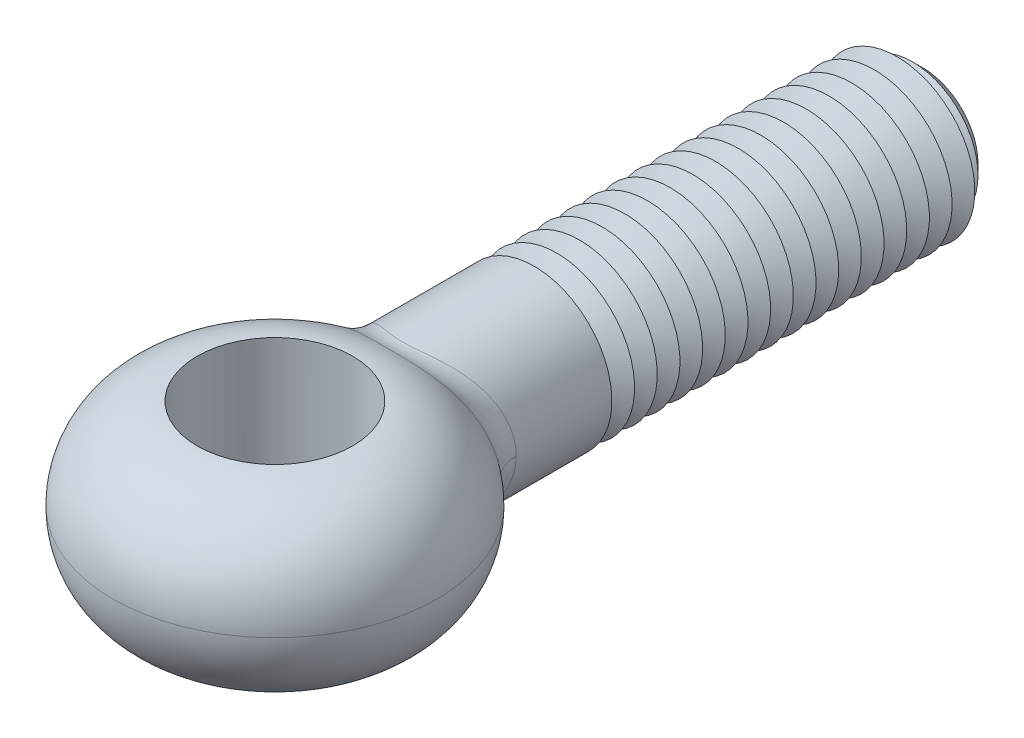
ISO-10303-21;
HEADER;
FILE_DESCRIPTION(('STEP AP214'),'2;1');
FILE_NAME('part.step','',(''),(''),'','','');
FILE_SCHEMA(('AUTOMOTIVE_DESIGN { 1 0 10303 214 1 1 1 1 }'));
ENDSEC;
DATA;
#1=APPLICATION_CONTEXT('core data for automotive mechanical design processes');
#2=APPLICATION_PROTOCOL_DEFINITION('international standard','automotive_design',2000,#1);
#3=PRODUCT_CONTEXT('',#1,'mechanical');
#4=PRODUCT('Part','Part','',(#3));
#5=PRODUCT_RELATED_PRODUCT_CATEGORY('part','',(#4));
#6=PRODUCT_DEFINITION_FORMATION('','',#4);
#7=PRODUCT_DEFINITION_CONTEXT('part definition',#1,'design');
#8=PRODUCT_DEFINITION('design','',#6,#7);
#9=PRODUCT_DEFINITION_SHAPE('','',#8);
#10=(LENGTH_UNIT() NAMED_UNIT(*) SI_UNIT(.MILLI.,.METRE.));
#11=(NAMED_UNIT(*) PLANE_ANGLE_UNIT() SI_UNIT($,.RADIAN.));
#12=(NAMED_UNIT(*) SI_UNIT($,.STERADIAN.) SOLID_ANGLE_UNIT());
#13=UNCERTAINTY_MEASURE_WITH_UNIT(LENGTH_MEASURE(1.E-05),#10,'distance_accuracy_value','');
#14=(GEOMETRIC_REPRESENTATION_CONTEXT(3) GLOBAL_UNCERTAINTY_ASSIGNED_CONTEXT((#13)) GLOBAL_UNIT_ASSIGNED_CONTEXT((#10,
#11,#12)) REPRESENTATION_CONTEXT('',''));
#15=CARTESIAN_POINT('',(0.,0.,0.));
#16=DIRECTION('',(0.,0.,1.));
#17=DIRECTION('',(1.,0.,0.));
#18=AXIS2_PLACEMENT_3D('',#15,#16,#17);
#19=CARTESIAN_POINT('',(0.,0.,-50.));
#20=DIRECTION('',(0.,0.,1.));
#21=DIRECTION('',(1.,0.,0.));
#22=AXIS2_PLACEMENT_3D('',#19,#20,#21);
#23=CYLINDRICAL_SURFACE('',#22,6.);
#24=CARTESIAN_POINT('',(0.,0.,-20.));
#25=DIRECTION('',(0.,0.,-1.));
#26=DIRECTION('',(-1.,0.,0.));
#27=AXIS2_PLACEMENT_3D('',#24,#25,#26);
#28=CIRCLE('',#27,6.);
#29=CARTESIAN_POINT('',(-6.,0.,-20.));
#30=VERTEX_POINT('',#29);
#31=EDGE_CURVE('E79',#30,#30,#28,.T.);
#32=ORIENTED_EDGE('',*,*,#31,.F.);
#33=EDGE_LOOP('',(#32));
#34=FACE_BOUND('',#33,.T.);
#35=CARTESIAN_POINT('',(5.9347688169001,-3.72936552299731,-9.76127797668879));
#36=CARTESIAN_POINT('',(5.01568840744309,-3.30684503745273,-10.6313747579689));
#37=CARTESIAN_POINT('',(4.83579180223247,-3.55177668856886,-11.9305846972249));
#38=CARTESIAN_POINT('',(6.04219931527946,-3.59564214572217,-9.79450956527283));
#39=CARTESIAN_POINT('',(5.09919553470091,-3.1795874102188,-10.6682119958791));
#40=CARTESIAN_POINT('',(4.92935060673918,-3.42442109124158,-11.9860495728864));
#41=CARTESIAN_POINT('',(6.1438473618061,-3.45763550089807,-9.82611020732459));
#42=CARTESIAN_POINT('',(5.17725322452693,-3.05002694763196,-10.702840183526));
#43=CARTESIAN_POINT('',(5.01812074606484,-3.29298619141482,-12.0386936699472));
#44=CARTESIAN_POINT('',(6.33498015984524,-3.17385997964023,-9.8857417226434));
#45=CARTESIAN_POINT('',(5.32290004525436,-2.78639390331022,-10.7677279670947));
#46=CARTESIAN_POINT('',(5.1853986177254,-3.02272379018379,-12.1378881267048));
#47=CARTESIAN_POINT('',(6.42446179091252,-3.02808912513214,-9.91377167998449));
#48=CARTESIAN_POINT('',(5.39041764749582,-2.65235488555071,-10.7979569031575));
#49=CARTESIAN_POINT('',(5.26390371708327,-2.88389440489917,-12.1844369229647));
#50=CARTESIAN_POINT('',(6.59063414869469,-2.72961135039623,-9.96594490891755));
#51=CARTESIAN_POINT('',(5.51491014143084,-2.38053035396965,-10.8538721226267));
#52=CARTESIAN_POINT('',(5.40994102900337,-2.5996298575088,-12.270973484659));
#53=CARTESIAN_POINT('',(6.66732079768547,-2.57690223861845,-9.99008694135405));
#54=CARTESIAN_POINT('',(5.57181683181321,-2.24279354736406,-10.8795284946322));
#55=CARTESIAN_POINT('',(5.47746974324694,-2.45419260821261,-12.3109591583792));
#56=CARTESIAN_POINT('',(6.80727548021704,-2.26566063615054,-10.0342164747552));
#57=CARTESIAN_POINT('',(5.67502497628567,-1.96438787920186,-10.9261769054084));
#58=CARTESIAN_POINT('',(5.60087770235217,-2.1577720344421,-12.3839763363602));
#59=CARTESIAN_POINT('',(6.87054514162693,-2.10712885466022,-10.0542044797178));
#60=CARTESIAN_POINT('',(5.72126980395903,-1.82378259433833,-10.9471437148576));
#61=CARTESIAN_POINT('',(5.65675836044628,-2.00678938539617,-12.4170086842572));
#62=CARTESIAN_POINT('',(7.03602672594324,-1.63406973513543,-10.1065323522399));
#63=CARTESIAN_POINT('',(5.84177866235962,-1.4066595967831,-11.0018788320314));
#64=CARTESIAN_POINT('',(5.80305576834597,-1.55625689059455,-12.5034220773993));
#65=CARTESIAN_POINT('',(7.11911563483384,-1.31267241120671,-10.1328771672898));
#66=CARTESIAN_POINT('',(5.90112324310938,-1.12766751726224,-11.0289752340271));
#67=CARTESIAN_POINT('',(5.87671572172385,-1.2501642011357,-12.5468355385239));
#68=CARTESIAN_POINT('',(7.23011866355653,-0.660856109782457,-10.1680856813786));
#69=CARTESIAN_POINT('',(5.98031743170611,-0.565466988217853,-11.0651706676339));
#70=CARTESIAN_POINT('',(5.97517391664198,-0.629386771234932,-12.6048310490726));
#71=CARTESIAN_POINT('',(7.25807152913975,-0.33044363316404,-10.1769616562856));
#72=CARTESIAN_POINT('',(6.00000388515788,-0.282923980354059,-11.0741952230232));
#73=CARTESIAN_POINT('',(6.0000064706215,-0.314708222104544,-12.6194333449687));
#74=CARTESIAN_POINT('',(7.25805738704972,0.335912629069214,-10.1769567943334));
#75=CARTESIAN_POINT('',(5.99999605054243,0.287606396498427,-11.0741911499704));
#76=CARTESIAN_POINT('',(5.99999342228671,0.319916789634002,-12.6194255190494));
#77=CARTESIAN_POINT('',(7.22915722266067,0.671857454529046,-10.1677796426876));
#78=CARTESIAN_POINT('',(5.97964504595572,0.574876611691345,-11.0648614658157));
#79=CARTESIAN_POINT('',(5.97431882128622,0.63986424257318,-12.6043279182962));
#80=CARTESIAN_POINT('',(7.11452740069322,1.33399050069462,-10.131423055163));
#81=CARTESIAN_POINT('',(5.89784251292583,1.14610230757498,-11.0274778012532));
#82=CARTESIAN_POINT('',(5.87264847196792,1.2704671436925,-12.5444393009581));
#83=CARTESIAN_POINT('',(7.02877559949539,1.66017486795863,-10.1042366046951));
#84=CARTESIAN_POINT('',(5.83657851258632,1.42936262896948,-10.9995093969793));
#85=CARTESIAN_POINT('',(5.79663311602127,1.58111892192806,-12.4996367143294));
#86=CARTESIAN_POINT('',(6.80343893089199,2.2930418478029,-10.0329875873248));
#87=CARTESIAN_POINT('',(5.67253761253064,1.98731296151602,-10.9250177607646));
#88=CARTESIAN_POINT('',(5.59744490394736,2.1838493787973,-12.3819651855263));
#89=CARTESIAN_POINT('',(6.66393326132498,2.59975238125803,-9.98894984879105));
#90=CARTESIAN_POINT('',(5.57019974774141,2.2614449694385,-10.8786920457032));
#91=CARTESIAN_POINT('',(5.47434142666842,2.47595464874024,-12.3091375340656));
#92=CARTESIAN_POINT('',(6.33535121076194,3.18625883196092,-9.88580293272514));
#93=CARTESIAN_POINT('',(5.32389744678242,2.79589244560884,-10.768093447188));
#94=CARTESIAN_POINT('',(5.18560859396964,3.03453222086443,-12.1380393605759));
#95=CARTESIAN_POINT('',(6.14627999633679,3.4660575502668,-9.82669532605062));
#96=CARTESIAN_POINT('',(5.18043230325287,3.05583228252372,-10.7040397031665));
#97=CARTESIAN_POINT('',(5.01998367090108,3.30100719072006,-12.0397714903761));
#98=CARTESIAN_POINT('',(5.7172577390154,4.00014270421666,-9.69400494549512));
#99=CARTESIAN_POINT('',(4.84766875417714,3.56284891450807,-10.5572649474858));
#100=CARTESIAN_POINT('',(4.64637499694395,3.8096597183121,-11.8183006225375));
#101=CARTESIAN_POINT('',(5.47601553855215,4.2534802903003,-9.62005911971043));
#102=CARTESIAN_POINT('',(4.65772328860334,3.80925143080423,-10.4742896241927));
#103=CARTESIAN_POINT('',(4.43732293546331,4.05093360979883,-11.694469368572));
#104=CARTESIAN_POINT('',(5.08259146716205,4.60342640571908,-9.50208552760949));
#105=CARTESIAN_POINT('',(4.34080391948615,4.15825147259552,-10.3388173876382));
#106=CARTESIAN_POINT('',(4.09924731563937,4.38421562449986,-11.4959320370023));
#107=CARTESIAN_POINT('',(4.9460782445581,4.71513594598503,-9.46155286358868));
#108=CARTESIAN_POINT('',(4.23020168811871,4.27084293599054,-10.2919789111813));
#109=CARTESIAN_POINT('',(3.98237779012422,4.49060566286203,-11.4275663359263));
#110=CARTESIAN_POINT('',(4.66296513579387,4.92813376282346,-9.37875537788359));
#111=CARTESIAN_POINT('',(3.99884628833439,4.48804462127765,-10.1953948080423));
#112=CARTESIAN_POINT('',(3.74115278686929,4.6934607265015,-11.2875507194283));
#113=CARTESIAN_POINT('',(4.5163679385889,5.0294247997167,-9.33649101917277));
#114=CARTESIAN_POINT('',(3.87815279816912,4.5926858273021,-10.1456674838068));
#115=CARTESIAN_POINT('',(3.61679930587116,4.78992838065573,-11.2159016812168));
#116=CARTESIAN_POINT('',(4.20225124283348,5.22831182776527,-9.24781094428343));
#117=CARTESIAN_POINT('',(3.61758964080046,4.80051594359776,-10.0403893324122));
#118=CARTESIAN_POINT('',(3.35180476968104,4.97934459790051,-11.0651470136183));
#119=CARTESIAN_POINT('',(4.03398632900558,5.3250780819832,-9.20131965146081));
#120=CARTESIAN_POINT('',(3.47696557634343,4.90311397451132,-9.98467073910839));
#121=CARTESIAN_POINT('',(3.21063957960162,5.07150293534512,-10.9858822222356));
#122=CARTESIAN_POINT('',(3.68652352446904,5.50578905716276,-9.10838168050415));
#123=CARTESIAN_POINT('',(3.18454628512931,5.09703954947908,-9.87225560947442));
#124=CARTESIAN_POINT('',(2.92111983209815,5.24360862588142,-10.8269291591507));
#125=CARTESIAN_POINT('',(3.50732357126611,5.5897313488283,-9.06193501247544));
#126=CARTESIAN_POINT('',(3.03278104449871,5.18843564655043,-9.81555489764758));
#127=CARTESIAN_POINT('',(2.77276391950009,5.32355366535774,-10.7472408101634));
#128=CARTESIAN_POINT('',(3.13794087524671,5.74446425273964,-8.97062224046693));
#129=CARTESIAN_POINT('',(2.71821702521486,5.35884982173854,-9.70314483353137));
#130=CARTESIAN_POINT('',(2.46931336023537,5.47091833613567,-10.5900722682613));
#131=CARTESIAN_POINT('',(2.94775184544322,5.81524723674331,-8.92575706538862));
#132=CARTESIAN_POINT('',(2.55541416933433,5.43794512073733,-9.64741385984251));
#133=CARTESIAN_POINT('',(2.31421486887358,5.53833070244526,-10.5125933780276));
#134=CARTESIAN_POINT('',(2.55657851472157,5.9431564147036,-8.83975050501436));
#135=CARTESIAN_POINT('',(2.21925064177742,5.58238081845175,-9.53980556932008));
#136=CARTESIAN_POINT('',(1.99786735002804,5.66014896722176,-10.3636052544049));
#137=CARTESIAN_POINT('',(2.35559801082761,6.00028737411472,-8.79860782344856));
#138=CARTESIAN_POINT('',(2.04585622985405,5.64781946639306,-9.48788433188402));
#139=CARTESIAN_POINT('',(1.83662049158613,5.71455940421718,-10.2920939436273));
#140=CARTESIAN_POINT('',(1.85774191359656,6.12093796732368,-8.70719486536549));
#141=CARTESIAN_POINT('',(1.61559271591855,5.78713197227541,-9.37194513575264));
#142=CARTESIAN_POINT('',(1.4406271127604,5.82946473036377,-10.1327613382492));
#143=CARTESIAN_POINT('',(1.55532271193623,6.17747996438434,-8.6600942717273));
#144=CARTESIAN_POINT('',(1.3529723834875,5.8538439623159,-9.31142342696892));
#145=CARTESIAN_POINT('',(1.20284157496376,5.88331425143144,-10.0502669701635));
#146=CARTESIAN_POINT('',(1.0891409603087,6.23930337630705,-8.60649289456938));
#147=CARTESIAN_POINT('',(0.947579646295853,5.92726352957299,-9.242285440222));
#148=CARTESIAN_POINT('',(0.83982684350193,5.94219369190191,-9.95617208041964));
#149=CARTESIAN_POINT('',(0.931962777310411,6.25606948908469,-8.59147969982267));
#150=CARTESIAN_POINT('',(0.810874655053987,5.94729550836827,-9.22285403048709));
#151=CARTESIAN_POINT('',(0.718001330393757,5.95816141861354,-9.92977025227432));
#152=CARTESIAN_POINT('',(0.614462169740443,6.2817502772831,-8.56819097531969));
#153=CARTESIAN_POINT('',(0.534722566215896,5.97803723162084,-9.19268813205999));
#154=CARTESIAN_POINT('',(0.472694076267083,5.98261931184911,-9.88878715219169));
#155=CARTESIAN_POINT('',(0.454140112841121,6.29066586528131,-8.5599146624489));
#156=CARTESIAN_POINT('',(0.395193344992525,5.98876738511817,-9.18193414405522));
#157=CARTESIAN_POINT('',(0.349212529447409,5.9911103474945,-9.87420450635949));
#158=CARTESIAN_POINT('',(0.131049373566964,6.30047562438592,-8.55079683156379));
#159=CARTESIAN_POINT('',(0.114068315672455,6.00056854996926,-9.17009294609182));
#160=CARTESIAN_POINT('',(0.100687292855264,6.00045297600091,-9.85813795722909));
#161=CARTESIAN_POINT('',(-0.0317286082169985,6.30131187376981,-8.55000899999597));
#162=CARTESIAN_POINT('',(-0.0276309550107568,6.00157787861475,-9.16906745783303));
#163=CARTESIAN_POINT('',(-0.02436125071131,6.00124940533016,-9.85674863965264));
#164=CARTESIAN_POINT('',(-0.356412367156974,6.29479284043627,-8.55608280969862));
#165=CARTESIAN_POINT('',(-0.31015318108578,5.99373179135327,-9.1769575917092));
#166=CARTESIAN_POINT('',(-0.274003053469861,5.9950408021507,-9.86745275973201));
#167=CARTESIAN_POINT('',(-0.518318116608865,6.28743729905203,-8.56294469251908));
#168=CARTESIAN_POINT('',(-0.451073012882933,5.98487067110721,-9.18587895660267));
#169=CARTESIAN_POINT('',(-0.398596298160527,5.98803552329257,-9.87954662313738));
#170=CARTESIAN_POINT('',(-0.839832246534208,6.26466677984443,-8.583729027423));
#171=CARTESIAN_POINT('',(-0.730746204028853,5.95757663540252,-9.21281914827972));
#172=CARTESIAN_POINT('',(-0.646718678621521,5.96634931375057,-9.91613502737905));
#173=CARTESIAN_POINT('',(-0.999430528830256,6.24922351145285,-8.59767625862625));
#174=CARTESIAN_POINT('',(-0.869577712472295,5.93909230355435,-9.23088715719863));
#175=CARTESIAN_POINT('',(-0.770242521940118,5.95164143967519,-9.94067308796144));
#176=CARTESIAN_POINT('',(-1.31437481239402,6.21055073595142,-8.63153922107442));
#177=CARTESIAN_POINT('',(-1.14330359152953,5.89311724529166,-9.27458059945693));
#178=CARTESIAN_POINT('',(-1.01506554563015,5.91481022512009,-10.0001513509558));
#179=CARTESIAN_POINT('',(-1.46971907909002,6.18731810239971,-8.65145734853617));
#180=CARTESIAN_POINT('',(-1.27826760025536,5.86559591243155,-9.30023316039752));
#181=CARTESIAN_POINT('',(-1.13636381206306,5.89268390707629,-10.0350957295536));
#182=CARTESIAN_POINT('',(-1.82539603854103,6.12454062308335,-8.70327656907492));
#183=CARTESIAN_POINT('',(-1.58698911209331,5.79180104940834,-9.36667644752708));
#184=CARTESIAN_POINT('',(-1.41557604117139,5.83289583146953,-10.1258248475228));
#185=CARTESIAN_POINT('',(-2.02378988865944,6.08214516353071,-8.73696553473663));
#186=CARTESIAN_POINT('',(-1.75893471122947,5.74230420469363,-9.40969592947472));
#187=CARTESIAN_POINT('',(-1.57246341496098,5.79251920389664,-10.184686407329));
#188=CARTESIAN_POINT('',(-2.41092164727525,5.98480792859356,-8.80979727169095));
#189=CARTESIAN_POINT('',(-2.09355200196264,5.63009686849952,-9.50199744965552));
#190=CARTESIAN_POINT('',(-1.880970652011,5.69981707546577,-10.3115469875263));
#191=CARTESIAN_POINT('',(-2.5996560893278,5.92986168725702,-8.84894198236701));
#192=CARTESIAN_POINT('',(-2.25629041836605,5.56730096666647,-9.55133195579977));
#193=CARTESIAN_POINT('',(-2.03258861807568,5.64748732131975,-10.3795492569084));
#194=CARTESIAN_POINT('',(-2.96755778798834,5.80783248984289,-8.93044371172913));
#195=CARTESIAN_POINT('',(-2.57232712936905,5.42968443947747,-9.65322105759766));
#196=CARTESIAN_POINT('',(-2.33036981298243,5.53126903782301,-10.5206862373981));
#197=CARTESIAN_POINT('',(-3.14671697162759,5.74073949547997,-8.97280337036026));
#198=CARTESIAN_POINT('',(-2.72564626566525,5.35477585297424,-9.70581299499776));
#199=CARTESIAN_POINT('',(-2.47652840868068,5.46737094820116,-10.593825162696));
#200=CARTESIAN_POINT('',(-3.49533769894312,5.59480022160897,-9.05896053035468));
#201=CARTESIAN_POINT('',(-3.02253770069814,5.19403391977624,-9.81188119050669));
#202=CARTESIAN_POINT('',(-2.76291205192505,5.32838116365,-10.742122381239));
#203=CARTESIAN_POINT('',(-3.66480050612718,5.51595547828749,-9.10275784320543));
#204=CARTESIAN_POINT('',(-3.16610934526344,5.10813119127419,-9.86537600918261));
#205=CARTESIAN_POINT('',(-2.90313787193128,5.2532909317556,-10.8172804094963));
#206=CARTESIAN_POINT('',(-3.99928684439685,5.34409495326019,-9.19187849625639));
#207=CARTESIAN_POINT('',(-3.44784552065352,4.92340384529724,-9.97329692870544));
#208=CARTESIAN_POINT('',(-3.18162491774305,5.08961424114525,-10.9697608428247));
#209=CARTESIAN_POINT('',(-4.16399459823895,5.25070632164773,-9.23720580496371));
#210=CARTESIAN_POINT('',(-3.58564022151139,4.82420269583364,-10.027694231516));
#211=CARTESIAN_POINT('',(-3.31967954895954,5.00067268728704,-11.0470755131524));
#212=CARTESIAN_POINT('',(-4.48282170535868,5.05207061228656,-9.32687019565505));
#213=CARTESIAN_POINT('',(-3.85050097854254,4.61613017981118,-10.1343299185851));
#214=CARTESIAN_POINT('',(-3.58838451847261,4.8114958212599,-11.1995795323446));
#215=CARTESIAN_POINT('',(-4.63694077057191,4.94682321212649,-9.37120725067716));
#216=CARTESIAN_POINT('',(-3.97751767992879,4.50720729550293,-10.1865592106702));
#217=CARTESIAN_POINT('',(-3.71903465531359,4.71126020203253,-11.2747688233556));
#218=CARTESIAN_POINT('',(-4.93402321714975,4.72498798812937,-9.45797232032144));
#219=CARTESIAN_POINT('',(-4.22045615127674,4.28075328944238,-10.2878502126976));
#220=CARTESIAN_POINT('',(-3.97205735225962,4.49998856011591,-11.421526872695));
#221=CARTESIAN_POINT('',(-5.0769962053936,4.60841012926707,-9.50040196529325));
#222=CARTESIAN_POINT('',(-4.33632375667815,4.16319510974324,-10.3368953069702));
#223=CARTESIAN_POINT('',(-4.09443702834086,4.38896202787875,-11.4930987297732));
#224=CARTESIAN_POINT('',(-5.35139946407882,4.36431803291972,-9.58269705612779));
#225=CARTESIAN_POINT('',(-4.55686646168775,3.92030762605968,-10.4311837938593));
#226=CARTESIAN_POINT('',(-4.3302405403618,4.15649336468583,-11.6315929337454));
#227=CARTESIAN_POINT('',(-5.48282554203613,4.2367998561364,-9.62256156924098));
#228=CARTESIAN_POINT('',(-4.66146230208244,3.79496029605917,-10.476398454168));
#229=CARTESIAN_POINT('',(-4.44366112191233,4.03504748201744,-11.6985135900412));
#230=CARTESIAN_POINT('',(-5.73992249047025,3.96459248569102,-9.70111653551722));
#231=CARTESIAN_POINT('',(-4.86435688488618,3.53075699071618,-10.5647509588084));
#232=CARTESIAN_POINT('',(-4.66626199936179,3.77580236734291,-11.8301121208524));
#233=CARTESIAN_POINT('',(-5.86493730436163,3.81935492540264,-9.73963775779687));
#234=CARTESIAN_POINT('',(-4.96192595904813,3.39157605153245,-10.6076101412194));
#235=CARTESIAN_POINT('',(-4.77491394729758,3.6374808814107,-11.894491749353));
#236=CARTESIAN_POINT('',(-6.10049317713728,3.5184514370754,-9.81259595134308));
#237=CARTESIAN_POINT('',(-5.14414695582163,3.10685040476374,-10.6881097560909));
#238=CARTESIAN_POINT('',(-4.98021019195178,3.35090613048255,-12.0161983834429));
#239=CARTESIAN_POINT('',(-6.21103492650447,3.36278600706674,-9.84703311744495));
#240=CARTESIAN_POINT('',(-5.22870245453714,2.96133570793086,-10.7257098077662));
#241=CARTESIAN_POINT('',(-5.07685506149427,3.20265333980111,-12.0735257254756));
#242=CARTESIAN_POINT('',(-6.41684087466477,3.04200182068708,-9.91136789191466));
#243=CARTESIAN_POINT('',(-5.38481615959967,2.66492089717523,-10.7954268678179));
#244=CARTESIAN_POINT('',(-5.25718892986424,2.89714459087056,-12.1804567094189));
#245=CARTESIAN_POINT('',(-6.51209487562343,2.87687685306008,-9.941262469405));
#246=CARTESIAN_POINT('',(-5.45627120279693,2.51407150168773,-10.8274993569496));
#247=CARTESIAN_POINT('',(-5.34086927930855,2.73988271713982,-12.230055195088));
#248=CARTESIAN_POINT('',(-6.68634060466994,2.53862818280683,-9.99606907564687));
#249=CARTESIAN_POINT('',(-5.58600966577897,2.20820283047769,-10.8859198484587));
#250=CARTESIAN_POINT('',(-5.49420876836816,2.41774112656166,-12.3208709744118));
#251=CARTESIAN_POINT('',(-6.7653416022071,2.365509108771,-10.0209839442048));
#252=CARTESIAN_POINT('',(-5.64421437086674,2.05326176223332,-10.9122330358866));
#253=CARTESIAN_POINT('',(-5.56387589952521,2.25286581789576,-12.3620930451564));
#254=CARTESIAN_POINT('',(-6.90530331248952,2.01532499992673,-10.0651851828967));
#255=CARTESIAN_POINT('',(-5.7466982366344,1.74251049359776,-10.9586742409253));
#256=CARTESIAN_POINT('',(-5.68746016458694,1.91935714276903,-12.4351539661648));
#257=CARTESIAN_POINT('',(-6.96652294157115,1.83836168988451,-10.0845522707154));
#258=CARTESIAN_POINT('',(-5.79110883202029,1.58683531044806,-10.9788602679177));
#259=CARTESIAN_POINT('',(-5.74160317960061,1.75082065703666,-12.4671274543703));
#260=CARTESIAN_POINT('',(-7.07189656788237,1.47955191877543,-10.1179144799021));
#261=CARTESIAN_POINT('',(-5.86721134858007,1.27322299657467,-11.0135080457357));
#262=CARTESIAN_POINT('',(-5.83487815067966,1.40909706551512,-12.5221684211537));
#263=CARTESIAN_POINT('',(-7.11605858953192,1.29770779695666,-10.1319121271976));
#264=CARTESIAN_POINT('',(-5.89885329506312,1.11539297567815,-11.02794716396));
#265=CARTESIAN_POINT('',(-5.87401716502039,1.2359121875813,-12.5452400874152));
#266=CARTESIAN_POINT('',(-7.18688145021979,0.930719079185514,-10.1543694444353));
#267=CARTESIAN_POINT('',(-5.9494736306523,0.79823853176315,-11.0510690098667));
#268=CARTESIAN_POINT('',(-5.93681662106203,0.886399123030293,-12.5822406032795));
#269=CARTESIAN_POINT('',(-7.21355030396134,0.745576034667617,-10.1628316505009));
#270=CARTESIAN_POINT('',(-5.9684191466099,0.639031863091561,-11.0597367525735));
#271=CARTESIAN_POINT('',(-5.96048415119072,0.710072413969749,-12.5961736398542));
#272=CARTESIAN_POINT('',(-7.24914599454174,0.373651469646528,-10.1741279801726));
#273=CARTESIAN_POINT('',(-5.99369065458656,0.319847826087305,-11.0713030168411));
#274=CARTESIAN_POINT('',(-5.99208005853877,0.355858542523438,-12.6147701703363));
#275=CARTESIAN_POINT('',(-7.25807450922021,0.186870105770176,-10.1769626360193));
#276=CARTESIAN_POINT('',(-5.999998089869,0.159994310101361,-11.074193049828));
#277=CARTESIAN_POINT('',(-6.00000992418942,0.17797152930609,-12.6194345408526));
#278=CARTESIAN_POINT('',(-7.25804656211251,-0.335738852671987,-10.1769531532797));
#279=CARTESIAN_POINT('',(-6.0000034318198,-0.287452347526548,-11.0741934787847));
#280=CARTESIAN_POINT('',(-5.99998216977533,-0.31975128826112,-12.6194203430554));
#281=CARTESIAN_POINT('',(-7.22917576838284,-0.671764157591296,-10.1677860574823));
#282=CARTESIAN_POINT('',(-5.97966209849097,-0.574787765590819,-11.0648695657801));
#283=CARTESIAN_POINT('',(-5.97433528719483,-0.639775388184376,-12.6043385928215));
#284=CARTESIAN_POINT('',(-7.1145105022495,-1.33407428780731,-10.1314171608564));
#285=CARTESIAN_POINT('',(-5.8978267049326,-1.14618252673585,-11.0274702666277));
#286=CARTESIAN_POINT('',(-5.8726334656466,-1.27054694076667,-12.5444294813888));
#287=CARTESIAN_POINT('',(-7.02869303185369,-1.66035512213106,-10.1042080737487));
#288=CARTESIAN_POINT('',(-5.83651996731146,-1.42954497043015,-10.999480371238));
#289=CARTESIAN_POINT('',(-5.79655816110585,-1.58129059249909,-12.4995901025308));
#290=CARTESIAN_POINT('',(-6.85971870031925,-2.13500368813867,-10.0507838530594));
#291=CARTESIAN_POINT('',(-5.71335936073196,-1.84847480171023,-10.9435562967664));
#292=CARTESIAN_POINT('',(-5.64719485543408,-2.03333684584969,-12.411356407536));
#293=CARTESIAN_POINT('',(-6.79670689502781,-2.29072029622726,-10.0308806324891));
#294=CARTESIAN_POINT('',(-5.66726413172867,-1.98670630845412,-10.9226633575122));
#295=CARTESIAN_POINT('',(-5.59155053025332,-2.18163837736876,-12.3784603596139));
#296=CARTESIAN_POINT('',(-6.65771758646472,-2.59645969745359,-9.98706290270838));
#297=CARTESIAN_POINT('',(-5.56469443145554,-2.26041067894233,-10.8763159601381));
#298=CARTESIAN_POINT('',(-5.46901133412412,-2.47281875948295,-12.3059514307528));
#299=CARTESIAN_POINT('',(-6.58173903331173,-2.74648202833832,-9.96314806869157));
#300=CARTESIAN_POINT('',(-5.50827469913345,-2.395823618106,-10.8508858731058));
#301=CARTESIAN_POINT('',(-5.40211555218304,-2.61569716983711,-12.2663380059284));
#302=CARTESIAN_POINT('',(-6.41741234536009,-3.03976673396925,-9.91156293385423));
#303=CARTESIAN_POINT('',(-5.38510014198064,-2.6630812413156,-10.7955752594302));
#304=CARTESIAN_POINT('',(-5.25771751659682,-2.89501593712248,-12.180769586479));
#305=CARTESIAN_POINT('',(-6.32906900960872,-3.18303170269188,-9.88389409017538));
#306=CARTESIAN_POINT('',(-5.3184112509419,-2.79488018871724,-10.7657236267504));
#307=CARTESIAN_POINT('',(-5.18021937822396,-3.03145876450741,-12.1348170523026));
#308=CARTESIAN_POINT('',(-6.14060484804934,-3.46203414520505,-9.82510194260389));
#309=CARTESIAN_POINT('',(-5.17475790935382,-3.05416625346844,-10.7017329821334));
#310=CARTESIAN_POINT('',(-5.01528894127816,-3.29717537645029,-12.0370139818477));
#311=CARTESIAN_POINT('',(-6.0404865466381,-3.5977732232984,-9.79397937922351));
#312=CARTESIAN_POINT('',(-5.09786126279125,-3.18162147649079,-10.6676230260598));
#313=CARTESIAN_POINT('',(-4.92785877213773,-3.42645068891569,-11.9851647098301));
#314=CARTESIAN_POINT('',(-5.9347688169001,-3.72936552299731,-9.76127797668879));
#315=CARTESIAN_POINT('',(-5.01568840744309,-3.30684503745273,-10.6313747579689));
#316=CARTESIAN_POINT('',(-4.83579180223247,-3.55177668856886,-11.9305846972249));
#317=(BOUNDED_SURFACE() B_SPLINE_SURFACE(3,2,((#35,#36,#37),(#38,#39,#40),(#41,#42,#43),(#44,
#45,#46),(#47,#48,#49),(#50,#51,#52),(#53,#54,#55),(#56,#57,#58),(#59,#60,#61),(#62,#63,#64),
(#65,#66,#67),(#68,#69,#70),(#71,#72,#73),(#74,#75,#76),(#77,#78,#79),(#80,#81,#82),(#83,#84,
#85),(#86,#87,#88),(#89,#90,#91),(#92,#93,#94),(#95,#96,#97),(#98,#99,#100),(#101,#102,#103),
(#104,#105,#106),(#107,#108,#109),(#110,#111,#112),(#113,#114,#115),(#116,#117,#118),(#119,#120,
#121),(#122,#123,#124),(#125,#126,#127),(#128,#129,#130),(#131,#132,#133),(#134,#135,#136),
(#137,#138,#139),(#140,#141,#142),(#143,#144,#145),(#146,#147,#148),(#149,#150,#151),(#152,#153,
#154),(#155,#156,#157),(#158,#159,#160),(#161,#162,#163),(#164,#165,#166),(#167,#168,#169),
(#170,#171,#172),(#173,#174,#175),(#176,#177,#178),(#179,#180,#181),(#182,#183,#184),(#185,#186,
#187),(#188,#189,#190),(#191,#192,#193),(#194,#195,#196),(#197,#198,#199),(#200,#201,#202),
(#203,#204,#205),(#206,#207,#208),(#209,#210,#211),(#212,#213,#214),(#215,#216,#217),(#218,#219,
#220),(#221,#222,#223),(#224,#225,#226),(#227,#228,#229),(#230,#231,#232),(#233,#234,#235),
(#236,#237,#238),(#239,#240,#241),(#242,#243,#244),(#245,#246,#247),(#248,#249,#250),(#251,#252,
#253),(#254,#255,#256),(#257,#258,#259),(#260,#261,#262),(#263,#264,#265),(#266,#267,#268),
(#269,#270,#271),(#272,#273,#274),(#275,#276,#277),(#278,#279,#280),(#281,#282,#283),(#284,#285,
#286),(#287,#288,#289),(#290,#291,#292),(#293,#294,#295),(#296,#297,#298),(#299,#300,#301),
(#302,#303,#304),(#305,#306,#307),(#308,#309,#310),(#311,#312,#313),(#314,#315,#316)),
.UNSPECIFIED.,.F.,.F.,.F.) B_SPLINE_SURFACE_WITH_KNOTS((4,2,2,2,2,2,2,2,2,2,2,2,2,2,2,2,2,2,2,2,
2,2,2,2,2,2,2,2,2,2,2,2,2,2,2,2,2,2,2,2,2,2,2,2,2,2,4),(3,3),(0.,0.730157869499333,
1.46050265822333,2.19107976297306,2.92156817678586,4.33710286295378,5.75164245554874,
7.18959333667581,8.62810462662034,10.0645045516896,11.5007548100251,12.9777469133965,
13.7173286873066,14.4567140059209,15.2508784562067,16.0451931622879,16.8399668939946,
17.6344627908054,18.7545699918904,19.3125249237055,19.8704149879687,20.4323016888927,
20.9942061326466,21.5580893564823,22.1221991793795,22.8711633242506,23.6203943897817,
24.3702474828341,25.1200026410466,25.8937593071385,26.6675370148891,27.440640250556,
28.214023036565,29.0276778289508,29.8412937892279,30.6554502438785,31.4691410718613,
32.2703098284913,33.0711012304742,33.8715254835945,34.6718740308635,36.109814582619,
37.5483362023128,38.2672339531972,38.986189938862,39.7048676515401,40.4233915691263),(0.,1.),
.UNSPECIFIED.) GEOMETRIC_REPRESENTATION_ITEM() RATIONAL_B_SPLINE_SURFACE(((1.,0.913704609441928,
1.),(1.,0.911808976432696,1.),(1.,0.909987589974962,1.),(1.,0.906521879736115,1.),(1.,
0.904877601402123,1.),(1.,0.901795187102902,1.),(1.,0.900357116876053,1.),(1.,0.897712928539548,
1.),(1.,0.896506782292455,1.),(1.,0.893335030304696,1.),(1.,0.891717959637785,1.),(1.,
0.889551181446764,1.),(1.,0.889000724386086,1.),(1.,0.88900105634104,1.),(1.,0.889570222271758,
1.),(1.,0.891807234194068,1.),(1.,0.893475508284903,1.),(1.,0.897791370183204,1.),(1.,
0.900437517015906,1.),(1.,0.90652846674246,1.),(1.,0.909973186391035,1.),(1.,0.917541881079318,
1.),(1.,0.921682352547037,1.),(1.,0.928122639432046,1.),(1.,0.930309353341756,1.),(1.,
0.934718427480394,1.),(1.,0.936940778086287,1.),(1.,0.941540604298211,1.),(1.,0.943917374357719,
1.),(1.,0.948597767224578,1.),(1.,0.9509013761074,1.),(1.,0.955362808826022,1.),(1.,
0.957520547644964,1.),(1.,0.961598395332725,1.),(1.,0.963518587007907,1.),(1.,0.967731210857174,
1.),(1.,0.969853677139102,1.),(1.,0.972244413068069,1.),(1.,0.972908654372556,1.),(1.,
0.973935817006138,1.),(1.,0.97429877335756,1.),(1.,0.974698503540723,1.),(1.,0.974732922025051,
1.),(1.,0.974466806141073,1.),(1.,0.974166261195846,1.),(1.,0.973250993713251,1.),(1.,
0.972635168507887,1.),(1.,0.9711286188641,1.),(1.,0.970237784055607,1.),(1.,0.967898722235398,
1.),(1.,0.966363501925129,1.),(1.,0.962996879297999,1.),(1.,0.961165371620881,1.),(1.,
0.957295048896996,1.),(1.,0.955256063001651,1.),(1.,0.951046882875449,1.),(1.,0.948876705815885,
1.),(1.,0.944396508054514,1.),(1.,0.942084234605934,1.),(1.,0.937444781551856,1.),(1.,
0.935117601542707,1.),(1.,0.93050246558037,1.),(1.,0.928214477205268,1.),(1.,0.923722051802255,
1.),(1.,0.921517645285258,1.),(1.,0.917125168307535,1.),(1.,0.914943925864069,1.),(1.,
0.910769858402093,1.),(1.,0.90877702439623,1.),(1.,0.905020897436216,1.),(1.,0.903257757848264,
1.),(1.,0.900001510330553,1.),(1.,0.898508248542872,1.),(1.,0.895843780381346,1.),(1.,
0.894667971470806,1.),(1.,0.892634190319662,1.),(1.,0.891776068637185,1.),(1.,0.890395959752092,
1.),(1.,0.889873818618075,1.),(1.,0.889176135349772,1.),(1.,0.889000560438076,1.),(1.,
0.889001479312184,1.),(1.,0.889569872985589,1.),(1.,0.89180755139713,1.),(1.,0.893477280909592,
1.),(1.,0.896713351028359,1.),(1.,0.897913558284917,1.),(1.,0.900537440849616,1.),(1.,
0.901961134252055,1.),(1.,0.905007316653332,1.),(1.,0.906629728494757,1.),(1.,0.910045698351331,
1.),(1.,0.911839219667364,1.),(1.,0.913704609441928,1.))) REPRESENTATION_ITEM('') SURFACE());
#318=CARTESIAN_POINT('',(-4.83579180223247,-3.55177668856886,-11.9305846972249));
#319=CARTESIAN_POINT('',(-4.92785877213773,-3.42645068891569,-11.9851647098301));
#320=CARTESIAN_POINT('',(-5.01528894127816,-3.29717537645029,-12.0370139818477));
#321=CARTESIAN_POINT('',(-5.18021937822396,-3.03145876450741,-12.1348170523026));
#322=CARTESIAN_POINT('',(-5.25771751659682,-2.89501593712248,-12.180769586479));
#323=CARTESIAN_POINT('',(-5.40211555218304,-2.61569716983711,-12.2663380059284));
#324=CARTESIAN_POINT('',(-5.46901133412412,-2.47281875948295,-12.3059514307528));
#325=CARTESIAN_POINT('',(-5.59155053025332,-2.18163837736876,-12.3784603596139));
#326=CARTESIAN_POINT('',(-5.64719485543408,-2.03333684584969,-12.411356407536));
#327=CARTESIAN_POINT('',(-5.79655816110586,-1.5812905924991,-12.4995901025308));
#328=CARTESIAN_POINT('',(-5.8726334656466,-1.27054694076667,-12.5444294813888));
#329=CARTESIAN_POINT('',(-5.97433528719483,-0.639775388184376,-12.6043385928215));
#330=CARTESIAN_POINT('',(-5.99998216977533,-0.31975128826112,-12.6194203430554));
#331=CARTESIAN_POINT('',(-6.00000992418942,0.17797152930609,-12.6194345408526));
#332=CARTESIAN_POINT('',(-5.99208005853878,0.355858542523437,-12.6147701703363));
#333=CARTESIAN_POINT('',(-5.96048415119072,0.71007241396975,-12.5961736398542));
#334=CARTESIAN_POINT('',(-5.93681662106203,0.886399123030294,-12.5822406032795));
#335=CARTESIAN_POINT('',(-5.87401716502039,1.2359121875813,-12.5452400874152));
#336=CARTESIAN_POINT('',(-5.83487815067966,1.40909706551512,-12.5221684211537));
#337=CARTESIAN_POINT('',(-5.74160317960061,1.75082065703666,-12.4671274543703));
#338=CARTESIAN_POINT('',(-5.68746016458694,1.91935714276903,-12.4351539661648));
#339=CARTESIAN_POINT('',(-5.56387589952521,2.25286581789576,-12.3620930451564));
#340=CARTESIAN_POINT('',(-5.49420876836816,2.41774112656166,-12.3208709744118));
#341=CARTESIAN_POINT('',(-5.34086927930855,2.73988271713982,-12.230055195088));
#342=CARTESIAN_POINT('',(-5.25718892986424,2.89714459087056,-12.1804567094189));
#343=CARTESIAN_POINT('',(-5.07685506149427,3.20265333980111,-12.0735257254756));
#344=CARTESIAN_POINT('',(-4.98021019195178,3.35090613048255,-12.0161983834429));
#345=CARTESIAN_POINT('',(-4.77491394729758,3.6374808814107,-11.894491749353));
#346=CARTESIAN_POINT('',(-4.66626199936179,3.77580236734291,-11.8301121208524));
#347=CARTESIAN_POINT('',(-4.44366112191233,4.03504748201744,-11.6985135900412));
#348=CARTESIAN_POINT('',(-4.3302405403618,4.15649336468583,-11.6315929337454));
#349=CARTESIAN_POINT('',(-4.09443702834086,4.38896202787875,-11.4930987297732));
#350=CARTESIAN_POINT('',(-3.97205735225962,4.49998856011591,-11.421526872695));
#351=CARTESIAN_POINT('',(-3.71903465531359,4.71126020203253,-11.2747688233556));
#352=CARTESIAN_POINT('',(-3.58838451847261,4.8114958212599,-11.1995795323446));
#353=CARTESIAN_POINT('',(-3.31967954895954,5.00067268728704,-11.0470755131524));
#354=CARTESIAN_POINT('',(-3.18162491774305,5.08961424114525,-10.9697608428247));
#355=CARTESIAN_POINT('',(-2.90313787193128,5.2532909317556,-10.8172804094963));
#356=CARTESIAN_POINT('',(-2.76291205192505,5.32838116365,-10.742122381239));
#357=CARTESIAN_POINT('',(-2.47652840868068,5.46737094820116,-10.593825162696));
#358=CARTESIAN_POINT('',(-2.33036981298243,5.53126903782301,-10.5206862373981));
#359=CARTESIAN_POINT('',(-2.03258861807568,5.64748732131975,-10.3795492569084));
#360=CARTESIAN_POINT('',(-1.880970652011,5.69981707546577,-10.3115469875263));
#361=CARTESIAN_POINT('',(-1.57246341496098,5.79251920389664,-10.184686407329));
#362=CARTESIAN_POINT('',(-1.41557604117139,5.83289583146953,-10.1258248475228));
#363=CARTESIAN_POINT('',(-1.13636381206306,5.89268390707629,-10.0350957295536));
#364=CARTESIAN_POINT('',(-1.01506554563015,5.91481022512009,-10.0001513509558));
#365=CARTESIAN_POINT('',(-0.770242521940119,5.95164143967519,-9.94067308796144));
#366=CARTESIAN_POINT('',(-0.64671867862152,5.96634931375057,-9.91613502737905));
#367=CARTESIAN_POINT('',(-0.398596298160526,5.98803552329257,-9.87954662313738));
#368=CARTESIAN_POINT('',(-0.274003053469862,5.9950408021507,-9.86745275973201));
#369=CARTESIAN_POINT('',(-0.0243612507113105,6.00124940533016,-9.85674863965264));
#370=CARTESIAN_POINT('',(0.100687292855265,6.00045297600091,-9.85813795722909));
#371=CARTESIAN_POINT('',(0.34921252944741,5.9911103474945,-9.87420450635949));
#372=CARTESIAN_POINT('',(0.472694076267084,5.98261931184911,-9.88878715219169));
#373=CARTESIAN_POINT('',(0.718001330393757,5.95816141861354,-9.92977025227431));
#374=CARTESIAN_POINT('',(0.83982684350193,5.94219369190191,-9.95617208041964));
#375=CARTESIAN_POINT('',(1.20284157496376,5.88331425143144,-10.0502669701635));
#376=CARTESIAN_POINT('',(1.4406271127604,5.82946473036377,-10.1327613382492));
#377=CARTESIAN_POINT('',(1.83662049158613,5.71455940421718,-10.2920939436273));
#378=CARTESIAN_POINT('',(1.99786735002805,5.66014896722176,-10.3636052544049));
#379=CARTESIAN_POINT('',(2.31421486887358,5.53833070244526,-10.5125933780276));
#380=CARTESIAN_POINT('',(2.46931336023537,5.47091833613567,-10.5900722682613));
#381=CARTESIAN_POINT('',(2.77276391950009,5.32355366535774,-10.7472408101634));
#382=CARTESIAN_POINT('',(2.92111983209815,5.24360862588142,-10.8269291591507));
#383=CARTESIAN_POINT('',(3.21063957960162,5.07150293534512,-10.9858822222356));
#384=CARTESIAN_POINT('',(3.35180476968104,4.97934459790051,-11.0651470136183));
#385=CARTESIAN_POINT('',(3.61679930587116,4.78992838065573,-11.2159016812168));
#386=CARTESIAN_POINT('',(3.74115278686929,4.6934607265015,-11.2875507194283));
#387=CARTESIAN_POINT('',(3.98237779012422,4.49060566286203,-11.4275663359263));
#388=CARTESIAN_POINT('',(4.09924731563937,4.38421562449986,-11.4959320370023));
#389=CARTESIAN_POINT('',(4.43732293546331,4.05093360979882,-11.694469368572));
#390=CARTESIAN_POINT('',(4.64637499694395,3.8096597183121,-11.8183006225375));
#391=CARTESIAN_POINT('',(5.01998367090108,3.30100719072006,-12.0397714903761));
#392=CARTESIAN_POINT('',(5.18560859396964,3.03453222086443,-12.1380393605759));
#393=CARTESIAN_POINT('',(5.47434142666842,2.47595464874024,-12.3091375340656));
#394=CARTESIAN_POINT('',(5.59744490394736,2.1838493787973,-12.3819651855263));
#395=CARTESIAN_POINT('',(5.79663311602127,1.58111892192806,-12.4996367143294));
#396=CARTESIAN_POINT('',(5.87264847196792,1.2704671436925,-12.5444393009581));
#397=CARTESIAN_POINT('',(5.97431882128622,0.63986424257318,-12.6043279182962));
#398=CARTESIAN_POINT('',(5.99999342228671,0.319916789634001,-12.6194255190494));
#399=CARTESIAN_POINT('',(6.0000064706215,-0.314708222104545,-12.6194333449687));
#400=CARTESIAN_POINT('',(5.97517391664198,-0.629386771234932,-12.6048310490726));
#401=CARTESIAN_POINT('',(5.87671572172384,-1.2501642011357,-12.5468355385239));
#402=CARTESIAN_POINT('',(5.80305576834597,-1.55625689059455,-12.5034220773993));
#403=CARTESIAN_POINT('',(5.65675836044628,-2.00678938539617,-12.4170086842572));
#404=CARTESIAN_POINT('',(5.60087770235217,-2.1577720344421,-12.3839763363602));
#405=CARTESIAN_POINT('',(5.47746974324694,-2.45419260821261,-12.3109591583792));
#406=CARTESIAN_POINT('',(5.40994102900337,-2.5996298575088,-12.270973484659));
#407=CARTESIAN_POINT('',(5.26390371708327,-2.88389440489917,-12.1844369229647));
#408=CARTESIAN_POINT('',(5.1853986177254,-3.02272379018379,-12.1378881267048));
#409=CARTESIAN_POINT('',(5.01812074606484,-3.29298619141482,-12.0386936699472));
#410=CARTESIAN_POINT('',(4.92935060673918,-3.42442109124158,-11.9860495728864));
#411=CARTESIAN_POINT('',(4.83579180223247,-3.55177668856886,-11.9305846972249));
#412=B_SPLINE_CURVE_WITH_KNOTS('',3,(#318,#319,#320,#321,#322,#323,#324,#325,#326,#327,#328,
#329,#330,#331,#332,#333,#334,#335,#336,#337,#338,#339,#340,#341,#342,#343,#344,#345,#346,#347,
#348,#349,#350,#351,#352,#353,#354,#355,#356,#357,#358,#359,#360,#361,#362,#363,#364,#365,#366,
#367,#368,#369,#370,#371,#372,#373,#374,#375,#376,#377,#378,#379,#380,#381,#382,#383,#384,#385,
#386,#387,#388,#389,#390,#391,#392,#393,#394,#395,#396,#397,#398,#399,#400,#401,#402,#403,#404,
#405,#406,#407,#408,#409,#410,#411),.UNSPECIFIED.,.F.,.F.,(4,2,2,2,2,2,2,2,2,2,2,2,2,2,2,2,2,2,
2,2,2,2,2,2,2,2,2,2,2,2,2,2,2,2,2,2,2,2,2,2,2,2,2,2,2,2,4),(0.,0.718523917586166,
1.43720163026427,2.15615761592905,2.87505536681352,4.31357698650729,5.7515175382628,
6.55186608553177,7.35229033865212,8.15308174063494,8.95425049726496,9.76794132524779,
10.5820977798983,11.3957137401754,12.2093685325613,12.9827513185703,13.7558545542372,
14.5296322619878,15.3033889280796,16.0531440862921,16.8029971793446,17.5522282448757,
18.3011923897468,18.865302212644,19.4291854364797,19.9910898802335,20.5529765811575,
21.1108666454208,21.6688215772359,22.7889287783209,23.5834246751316,24.3781984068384,
25.1725131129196,25.9666775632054,26.7060628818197,27.4456446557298,28.9226367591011,
30.3588870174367,31.7952869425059,33.2337982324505,34.6717491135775,36.0862887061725,
37.5018233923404,38.2323118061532,38.9628889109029,39.6932336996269,40.4233915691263),.UNSPECIFIED.);
#413=CARTESIAN_POINT('',(-6.,0.,-12.619429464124));
#414=VERTEX_POINT('',#413);
#415=CARTESIAN_POINT('',(6.,0.,-12.619429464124));
#416=VERTEX_POINT('',#415);
#417=EDGE_CURVE('E81',#414,#416,#412,.T.);
#418=ORIENTED_EDGE('',*,*,#417,.T.);
#419=CARTESIAN_POINT('',(-5.9347688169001,3.72936552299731,-9.76127797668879));
#420=CARTESIAN_POINT('',(-5.01568840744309,3.30684503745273,-10.6313747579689));
#421=CARTESIAN_POINT('',(-4.83579180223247,3.55177668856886,-11.9305846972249));
#422=CARTESIAN_POINT('',(-6.04219931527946,3.59564214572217,-9.79450956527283));
#423=CARTESIAN_POINT('',(-5.09919553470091,3.1795874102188,-10.6682119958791));
#424=CARTESIAN_POINT('',(-4.92935060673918,3.42442109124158,-11.9860495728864));
#425=CARTESIAN_POINT('',(-6.1438473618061,3.45763550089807,-9.82611020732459));
#426=CARTESIAN_POINT('',(-5.17725322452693,3.05002694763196,-10.702840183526));
#427=CARTESIAN_POINT('',(-5.01812074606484,3.29298619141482,-12.0386936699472));
#428=CARTESIAN_POINT('',(-6.33498015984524,3.17385997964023,-9.8857417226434));
#429=CARTESIAN_POINT('',(-5.32290004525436,2.78639390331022,-10.7677279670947));
#430=CARTESIAN_POINT('',(-5.1853986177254,3.02272379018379,-12.1378881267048));
#431=CARTESIAN_POINT('',(-6.42446179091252,3.02808912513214,-9.91377167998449));
#432=CARTESIAN_POINT('',(-5.39041764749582,2.65235488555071,-10.7979569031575));
#433=CARTESIAN_POINT('',(-5.26390371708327,2.88389440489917,-12.1844369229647));
#434=CARTESIAN_POINT('',(-6.59063414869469,2.72961135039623,-9.96594490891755));
#435=CARTESIAN_POINT('',(-5.51491014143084,2.38053035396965,-10.8538721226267));
#436=CARTESIAN_POINT('',(-5.40994102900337,2.5996298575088,-12.270973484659));
#437=CARTESIAN_POINT('',(-6.66732079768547,2.57690223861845,-9.99008694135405));
#438=CARTESIAN_POINT('',(-5.57181683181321,2.24279354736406,-10.8795284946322));
#439=CARTESIAN_POINT('',(-5.47746974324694,2.45419260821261,-12.3109591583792));
#440=CARTESIAN_POINT('',(-6.80727548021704,2.26566063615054,-10.0342164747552));
#441=CARTESIAN_POINT('',(-5.67502497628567,1.96438787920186,-10.9261769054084));
#442=CARTESIAN_POINT('',(-5.60087770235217,2.1577720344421,-12.3839763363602));
#443=CARTESIAN_POINT('',(-6.87054514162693,2.10712885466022,-10.0542044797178));
#444=CARTESIAN_POINT('',(-5.72126980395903,1.82378259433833,-10.9471437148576));
#445=CARTESIAN_POINT('',(-5.65675836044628,2.00678938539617,-12.4170086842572));
#446=CARTESIAN_POINT('',(-7.03602672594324,1.63406973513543,-10.1065323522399));
#447=CARTESIAN_POINT('',(-5.84177866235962,1.4066595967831,-11.0018788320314));
#448=CARTESIAN_POINT('',(-5.80305576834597,1.55625689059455,-12.5034220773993));
#449=CARTESIAN_POINT('',(-7.11911563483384,1.31267241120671,-10.1328771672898));
#450=CARTESIAN_POINT('',(-5.90112324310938,1.12766751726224,-11.0289752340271));
#451=CARTESIAN_POINT('',(-5.87671572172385,1.2501642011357,-12.5468355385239));
#452=CARTESIAN_POINT('',(-7.23011866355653,0.660856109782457,-10.1680856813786));
#453=CARTESIAN_POINT('',(-5.98031743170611,0.565466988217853,-11.0651706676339));
#454=CARTESIAN_POINT('',(-5.97517391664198,0.629386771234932,-12.6048310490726));
#455=CARTESIAN_POINT('',(-7.25807152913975,0.33044363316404,-10.1769616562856));
#456=CARTESIAN_POINT('',(-6.00000388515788,0.282923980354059,-11.0741952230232));
#457=CARTESIAN_POINT('',(-6.0000064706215,0.314708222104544,-12.6194333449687));
#458=CARTESIAN_POINT('',(-7.25805738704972,-0.335912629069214,-10.1769567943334));
#459=CARTESIAN_POINT('',(-5.99999605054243,-0.287606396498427,-11.0741911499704));
#460=CARTESIAN_POINT('',(-5.99999342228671,-0.319916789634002,-12.6194255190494));
#461=CARTESIAN_POINT('',(-7.22915722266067,-0.671857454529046,-10.1677796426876));
#462=CARTESIAN_POINT('',(-5.97964504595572,-0.574876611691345,-11.0648614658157));
#463=CARTESIAN_POINT('',(-5.97431882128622,-0.63986424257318,-12.6043279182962));
#464=CARTESIAN_POINT('',(-7.11452740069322,-1.33399050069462,-10.131423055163));
#465=CARTESIAN_POINT('',(-5.89784251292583,-1.14610230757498,-11.0274778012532));
#466=CARTESIAN_POINT('',(-5.87264847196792,-1.2704671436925,-12.5444393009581));
#467=CARTESIAN_POINT('',(-7.02877559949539,-1.66017486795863,-10.1042366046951));
#468=CARTESIAN_POINT('',(-5.83657851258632,-1.42936262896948,-10.9995093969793));
#469=CARTESIAN_POINT('',(-5.79663311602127,-1.58111892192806,-12.4996367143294));
#470=CARTESIAN_POINT('',(-6.80343893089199,-2.2930418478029,-10.0329875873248));
#471=CARTESIAN_POINT('',(-5.67253761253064,-1.98731296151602,-10.9250177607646));
#472=CARTESIAN_POINT('',(-5.59744490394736,-2.1838493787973,-12.3819651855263));
#473=CARTESIAN_POINT('',(-6.66393326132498,-2.59975238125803,-9.98894984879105));
#474=CARTESIAN_POINT('',(-5.57019974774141,-2.2614449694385,-10.8786920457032));
#475=CARTESIAN_POINT('',(-5.47434142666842,-2.47595464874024,-12.3091375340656));
#476=CARTESIAN_POINT('',(-6.33535121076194,-3.18625883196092,-9.88580293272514));
#477=CARTESIAN_POINT('',(-5.32389744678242,-2.79589244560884,-10.768093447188));
#478=CARTESIAN_POINT('',(-5.18560859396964,-3.03453222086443,-12.1380393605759));
#479=CARTESIAN_POINT('',(-6.14627999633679,-3.4660575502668,-9.82669532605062));
#480=CARTESIAN_POINT('',(-5.18043230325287,-3.05583228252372,-10.7040397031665));
#481=CARTESIAN_POINT('',(-5.01998367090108,-3.30100719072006,-12.0397714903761));
#482=CARTESIAN_POINT('',(-5.7172577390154,-4.00014270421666,-9.69400494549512));
#483=CARTESIAN_POINT('',(-4.84766875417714,-3.56284891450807,-10.5572649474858));
#484=CARTESIAN_POINT('',(-4.64637499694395,-3.8096597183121,-11.8183006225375));
#485=CARTESIAN_POINT('',(-5.47601553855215,-4.2534802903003,-9.62005911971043));
#486=CARTESIAN_POINT('',(-4.65772328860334,-3.80925143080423,-10.4742896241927));
#487=CARTESIAN_POINT('',(-4.43732293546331,-4.05093360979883,-11.694469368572));
#488=CARTESIAN_POINT('',(-5.08259146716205,-4.60342640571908,-9.50208552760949));
#489=CARTESIAN_POINT('',(-4.34080391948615,-4.15825147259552,-10.3388173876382));
#490=CARTESIAN_POINT('',(-4.09924731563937,-4.38421562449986,-11.4959320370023));
#491=CARTESIAN_POINT('',(-4.9460782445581,-4.71513594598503,-9.46155286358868));
#492=CARTESIAN_POINT('',(-4.23020168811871,-4.27084293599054,-10.2919789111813));
#493=CARTESIAN_POINT('',(-3.98237779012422,-4.49060566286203,-11.4275663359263));
#494=CARTESIAN_POINT('',(-4.66296513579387,-4.92813376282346,-9.37875537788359));
#495=CARTESIAN_POINT('',(-3.99884628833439,-4.48804462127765,-10.1953948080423));
#496=CARTESIAN_POINT('',(-3.74115278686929,-4.6934607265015,-11.2875507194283));
#497=CARTESIAN_POINT('',(-4.5163679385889,-5.0294247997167,-9.33649101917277));
#498=CARTESIAN_POINT('',(-3.87815279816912,-4.5926858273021,-10.1456674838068));
#499=CARTESIAN_POINT('',(-3.61679930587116,-4.78992838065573,-11.2159016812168));
#500=CARTESIAN_POINT('',(-4.20225124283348,-5.22831182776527,-9.24781094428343));
#501=CARTESIAN_POINT('',(-3.61758964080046,-4.80051594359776,-10.0403893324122));
#502=CARTESIAN_POINT('',(-3.35180476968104,-4.97934459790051,-11.0651470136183));
#503=CARTESIAN_POINT('',(-4.03398632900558,-5.3250780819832,-9.20131965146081));
#504=CARTESIAN_POINT('',(-3.47696557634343,-4.90311397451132,-9.98467073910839));
#505=CARTESIAN_POINT('',(-3.21063957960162,-5.07150293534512,-10.9858822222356));
#506=CARTESIAN_POINT('',(-3.68652352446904,-5.50578905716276,-9.10838168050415));
#507=CARTESIAN_POINT('',(-3.18454628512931,-5.09703954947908,-9.87225560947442));
#508=CARTESIAN_POINT('',(-2.92111983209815,-5.24360862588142,-10.8269291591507));
#509=CARTESIAN_POINT('',(-3.50732357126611,-5.5897313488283,-9.06193501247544));
#510=CARTESIAN_POINT('',(-3.03278104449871,-5.18843564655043,-9.81555489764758));
#511=CARTESIAN_POINT('',(-2.77276391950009,-5.32355366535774,-10.7472408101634));
#512=CARTESIAN_POINT('',(-3.13794087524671,-5.74446425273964,-8.97062224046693));
#513=CARTESIAN_POINT('',(-2.71821702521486,-5.35884982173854,-9.70314483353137));
#514=CARTESIAN_POINT('',(-2.46931336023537,-5.47091833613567,-10.5900722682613));
#515=CARTESIAN_POINT('',(-2.94775184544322,-5.81524723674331,-8.92575706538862));
#516=CARTESIAN_POINT('',(-2.55541416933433,-5.43794512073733,-9.64741385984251));
#517=CARTESIAN_POINT('',(-2.31421486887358,-5.53833070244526,-10.5125933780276));
#518=CARTESIAN_POINT('',(-2.55657851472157,-5.9431564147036,-8.83975050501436));
#519=CARTESIAN_POINT('',(-2.21925064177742,-5.58238081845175,-9.53980556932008));
#520=CARTESIAN_POINT('',(-1.99786735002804,-5.66014896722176,-10.3636052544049));
#521=CARTESIAN_POINT('',(-2.35559801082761,-6.00028737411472,-8.79860782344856));
#522=CARTESIAN_POINT('',(-2.04585622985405,-5.64781946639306,-9.48788433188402));
#523=CARTESIAN_POINT('',(-1.83662049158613,-5.71455940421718,-10.2920939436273));
#524=CARTESIAN_POINT('',(-1.85774191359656,-6.12093796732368,-8.70719486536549));
#525=CARTESIAN_POINT('',(-1.61559271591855,-5.78713197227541,-9.37194513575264));
#526=CARTESIAN_POINT('',(-1.4406271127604,-5.82946473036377,-10.1327613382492));
#527=CARTESIAN_POINT('',(-1.55532271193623,-6.17747996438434,-8.6600942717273));
#528=CARTESIAN_POINT('',(-1.3529723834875,-5.8538439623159,-9.31142342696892));
#529=CARTESIAN_POINT('',(-1.20284157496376,-5.88331425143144,-10.0502669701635));
#530=CARTESIAN_POINT('',(-1.0891409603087,-6.23930337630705,-8.60649289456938));
#531=CARTESIAN_POINT('',(-0.947579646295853,-5.92726352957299,-9.242285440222));
#532=CARTESIAN_POINT('',(-0.83982684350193,-5.94219369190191,-9.95617208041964));
#533=CARTESIAN_POINT('',(-0.931962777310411,-6.25606948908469,-8.59147969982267));
#534=CARTESIAN_POINT('',(-0.810874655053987,-5.94729550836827,-9.22285403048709));
#535=CARTESIAN_POINT('',(-0.718001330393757,-5.95816141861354,-9.92977025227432));
#536=CARTESIAN_POINT('',(-0.614462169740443,-6.2817502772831,-8.56819097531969));
#537=CARTESIAN_POINT('',(-0.534722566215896,-5.97803723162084,-9.19268813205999));
#538=CARTESIAN_POINT('',(-0.472694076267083,-5.98261931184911,-9.88878715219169));
#539=CARTESIAN_POINT('',(-0.454140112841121,-6.29066586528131,-8.5599146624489));
#540=CARTESIAN_POINT('',(-0.395193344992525,-5.98876738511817,-9.18193414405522));
#541=CARTESIAN_POINT('',(-0.349212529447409,-5.9911103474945,-9.87420450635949));
#542=CARTESIAN_POINT('',(-0.131049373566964,-6.30047562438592,-8.55079683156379));
#543=CARTESIAN_POINT('',(-0.114068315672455,-6.00056854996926,-9.17009294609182));
#544=CARTESIAN_POINT('',(-0.100687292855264,-6.00045297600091,-9.85813795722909));
#545=CARTESIAN_POINT('',(0.0317286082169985,-6.30131187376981,-8.55000899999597));
#546=CARTESIAN_POINT('',(0.0276309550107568,-6.00157787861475,-9.16906745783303));
#547=CARTESIAN_POINT('',(0.02436125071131,-6.00124940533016,-9.85674863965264));
#548=CARTESIAN_POINT('',(0.356412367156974,-6.29479284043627,-8.55608280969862));
#549=CARTESIAN_POINT('',(0.31015318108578,-5.99373179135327,-9.1769575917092));
#550=CARTESIAN_POINT('',(0.274003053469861,-5.9950408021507,-9.86745275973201));
#551=CARTESIAN_POINT('',(0.518318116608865,-6.28743729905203,-8.56294469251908));
#552=CARTESIAN_POINT('',(0.451073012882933,-5.98487067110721,-9.18587895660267));
#553=CARTESIAN_POINT('',(0.398596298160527,-5.98803552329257,-9.87954662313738));
#554=CARTESIAN_POINT('',(0.839832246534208,-6.26466677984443,-8.583729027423));
#555=CARTESIAN_POINT('',(0.730746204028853,-5.95757663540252,-9.21281914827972));
#556=CARTESIAN_POINT('',(0.646718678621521,-5.96634931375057,-9.91613502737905));
#557=CARTESIAN_POINT('',(0.999430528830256,-6.24922351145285,-8.59767625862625));
#558=CARTESIAN_POINT('',(0.869577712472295,-5.93909230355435,-9.23088715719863));
#559=CARTESIAN_POINT('',(0.770242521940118,-5.95164143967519,-9.94067308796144));
#560=CARTESIAN_POINT('',(1.31437481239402,-6.21055073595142,-8.63153922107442));
#561=CARTESIAN_POINT('',(1.14330359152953,-5.89311724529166,-9.27458059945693));
#562=CARTESIAN_POINT('',(1.01506554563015,-5.91481022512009,-10.0001513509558));
#563=CARTESIAN_POINT('',(1.46971907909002,-6.18731810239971,-8.65145734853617));
#564=CARTESIAN_POINT('',(1.27826760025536,-5.86559591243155,-9.30023316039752));
#565=CARTESIAN_POINT('',(1.13636381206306,-5.89268390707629,-10.0350957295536));
#566=CARTESIAN_POINT('',(1.82539603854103,-6.12454062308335,-8.70327656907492));
#567=CARTESIAN_POINT('',(1.58698911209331,-5.79180104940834,-9.36667644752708));
#568=CARTESIAN_POINT('',(1.41557604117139,-5.83289583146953,-10.1258248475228));
#569=CARTESIAN_POINT('',(2.02378988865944,-6.08214516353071,-8.73696553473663));
#570=CARTESIAN_POINT('',(1.75893471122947,-5.74230420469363,-9.40969592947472));
#571=CARTESIAN_POINT('',(1.57246341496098,-5.79251920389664,-10.184686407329));
#572=CARTESIAN_POINT('',(2.41092164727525,-5.98480792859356,-8.80979727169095));
#573=CARTESIAN_POINT('',(2.09355200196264,-5.63009686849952,-9.50199744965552));
#574=CARTESIAN_POINT('',(1.880970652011,-5.69981707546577,-10.3115469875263));
#575=CARTESIAN_POINT('',(2.5996560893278,-5.92986168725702,-8.84894198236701));
#576=CARTESIAN_POINT('',(2.25629041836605,-5.56730096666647,-9.55133195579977));
#577=CARTESIAN_POINT('',(2.03258861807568,-5.64748732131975,-10.3795492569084));
#578=CARTESIAN_POINT('',(2.96755778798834,-5.80783248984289,-8.93044371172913));
#579=CARTESIAN_POINT('',(2.57232712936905,-5.42968443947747,-9.65322105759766));
#580=CARTESIAN_POINT('',(2.33036981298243,-5.53126903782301,-10.5206862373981));
#581=CARTESIAN_POINT('',(3.14671697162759,-5.74073949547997,-8.97280337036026));
#582=CARTESIAN_POINT('',(2.72564626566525,-5.35477585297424,-9.70581299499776));
#583=CARTESIAN_POINT('',(2.47652840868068,-5.46737094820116,-10.593825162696));
#584=CARTESIAN_POINT('',(3.49533769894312,-5.59480022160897,-9.05896053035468));
#585=CARTESIAN_POINT('',(3.02253770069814,-5.19403391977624,-9.81188119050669));
#586=CARTESIAN_POINT('',(2.76291205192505,-5.32838116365,-10.742122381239));
#587=CARTESIAN_POINT('',(3.66480050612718,-5.51595547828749,-9.10275784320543));
#588=CARTESIAN_POINT('',(3.16610934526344,-5.10813119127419,-9.86537600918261));
#589=CARTESIAN_POINT('',(2.90313787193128,-5.2532909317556,-10.8172804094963));
#590=CARTESIAN_POINT('',(3.99928684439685,-5.34409495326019,-9.19187849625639));
#591=CARTESIAN_POINT('',(3.44784552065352,-4.92340384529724,-9.97329692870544));
#592=CARTESIAN_POINT('',(3.18162491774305,-5.08961424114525,-10.9697608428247));
#593=CARTESIAN_POINT('',(4.16399459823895,-5.25070632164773,-9.23720580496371));
#594=CARTESIAN_POINT('',(3.58564022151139,-4.82420269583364,-10.027694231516));
#595=CARTESIAN_POINT('',(3.31967954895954,-5.00067268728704,-11.0470755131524));
#596=CARTESIAN_POINT('',(4.48282170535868,-5.05207061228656,-9.32687019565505));
#597=CARTESIAN_POINT('',(3.85050097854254,-4.61613017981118,-10.1343299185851));
#598=CARTESIAN_POINT('',(3.58838451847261,-4.8114958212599,-11.1995795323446));
#599=CARTESIAN_POINT('',(4.63694077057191,-4.94682321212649,-9.37120725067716));
#600=CARTESIAN_POINT('',(3.97751767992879,-4.50720729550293,-10.1865592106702));
#601=CARTESIAN_POINT('',(3.71903465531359,-4.71126020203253,-11.2747688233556));
#602=CARTESIAN_POINT('',(4.93402321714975,-4.72498798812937,-9.45797232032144));
#603=CARTESIAN_POINT('',(4.22045615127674,-4.28075328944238,-10.2878502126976));
#604=CARTESIAN_POINT('',(3.97205735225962,-4.49998856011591,-11.421526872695));
#605=CARTESIAN_POINT('',(5.0769962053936,-4.60841012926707,-9.50040196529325));
#606=CARTESIAN_POINT('',(4.33632375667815,-4.16319510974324,-10.3368953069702));
#607=CARTESIAN_POINT('',(4.09443702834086,-4.38896202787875,-11.4930987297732));
#608=CARTESIAN_POINT('',(5.35139946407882,-4.36431803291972,-9.58269705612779));
#609=CARTESIAN_POINT('',(4.55686646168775,-3.92030762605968,-10.4311837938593));
#610=CARTESIAN_POINT('',(4.3302405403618,-4.15649336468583,-11.6315929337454));
#611=CARTESIAN_POINT('',(5.48282554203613,-4.2367998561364,-9.62256156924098));
#612=CARTESIAN_POINT('',(4.66146230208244,-3.79496029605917,-10.476398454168));
#613=CARTESIAN_POINT('',(4.44366112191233,-4.03504748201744,-11.6985135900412));
#614=CARTESIAN_POINT('',(5.73992249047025,-3.96459248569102,-9.70111653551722));
#615=CARTESIAN_POINT('',(4.86435688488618,-3.53075699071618,-10.5647509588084));
#616=CARTESIAN_POINT('',(4.66626199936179,-3.77580236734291,-11.8301121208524));
#617=CARTESIAN_POINT('',(5.86493730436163,-3.81935492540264,-9.73963775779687));
#618=CARTESIAN_POINT('',(4.96192595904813,-3.39157605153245,-10.6076101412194));
#619=CARTESIAN_POINT('',(4.77491394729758,-3.6374808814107,-11.894491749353));
#620=CARTESIAN_POINT('',(6.10049317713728,-3.5184514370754,-9.81259595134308));
#621=CARTESIAN_POINT('',(5.14414695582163,-3.10685040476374,-10.6881097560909));
#622=CARTESIAN_POINT('',(4.98021019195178,-3.35090613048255,-12.0161983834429));
#623=CARTESIAN_POINT('',(6.21103492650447,-3.36278600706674,-9.84703311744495));
#624=CARTESIAN_POINT('',(5.22870245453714,-2.96133570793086,-10.7257098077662));
#625=CARTESIAN_POINT('',(5.07685506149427,-3.20265333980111,-12.0735257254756));
#626=CARTESIAN_POINT('',(6.41684087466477,-3.04200182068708,-9.91136789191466));
#627=CARTESIAN_POINT('',(5.38481615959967,-2.66492089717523,-10.7954268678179));
#628=CARTESIAN_POINT('',(5.25718892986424,-2.89714459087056,-12.1804567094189));
#629=CARTESIAN_POINT('',(6.51209487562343,-2.87687685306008,-9.941262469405));
#630=CARTESIAN_POINT('',(5.45627120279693,-2.51407150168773,-10.8274993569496));
#631=CARTESIAN_POINT('',(5.34086927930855,-2.73988271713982,-12.230055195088));
#632=CARTESIAN_POINT('',(6.68634060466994,-2.53862818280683,-9.99606907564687));
#633=CARTESIAN_POINT('',(5.58600966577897,-2.20820283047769,-10.8859198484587));
#634=CARTESIAN_POINT('',(5.49420876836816,-2.41774112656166,-12.3208709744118));
#635=CARTESIAN_POINT('',(6.7653416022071,-2.365509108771,-10.0209839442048));
#636=CARTESIAN_POINT('',(5.64421437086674,-2.05326176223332,-10.9122330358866));
#637=CARTESIAN_POINT('',(5.56387589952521,-2.25286581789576,-12.3620930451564));
#638=CARTESIAN_POINT('',(6.90530331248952,-2.01532499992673,-10.0651851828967));
#639=CARTESIAN_POINT('',(5.7466982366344,-1.74251049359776,-10.9586742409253));
#640=CARTESIAN_POINT('',(5.68746016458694,-1.91935714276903,-12.4351539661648));
#641=CARTESIAN_POINT('',(6.96652294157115,-1.83836168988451,-10.0845522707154));
#642=CARTESIAN_POINT('',(5.79110883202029,-1.58683531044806,-10.9788602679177));
#643=CARTESIAN_POINT('',(5.74160317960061,-1.75082065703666,-12.4671274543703));
#644=CARTESIAN_POINT('',(7.07189656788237,-1.47955191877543,-10.1179144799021));
#645=CARTESIAN_POINT('',(5.86721134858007,-1.27322299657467,-11.0135080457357));
#646=CARTESIAN_POINT('',(5.83487815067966,-1.40909706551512,-12.5221684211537));
#647=CARTESIAN_POINT('',(7.11605858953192,-1.29770779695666,-10.1319121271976));
#648=CARTESIAN_POINT('',(5.89885329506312,-1.11539297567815,-11.02794716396));
#649=CARTESIAN_POINT('',(5.87401716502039,-1.2359121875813,-12.5452400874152));
#650=CARTESIAN_POINT('',(7.18688145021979,-0.930719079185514,-10.1543694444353));
#651=CARTESIAN_POINT('',(5.9494736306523,-0.79823853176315,-11.0510690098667));
#652=CARTESIAN_POINT('',(5.93681662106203,-0.886399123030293,-12.5822406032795));
#653=CARTESIAN_POINT('',(7.21355030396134,-0.745576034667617,-10.1628316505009));
#654=CARTESIAN_POINT('',(5.9684191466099,-0.639031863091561,-11.0597367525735));
#655=CARTESIAN_POINT('',(5.96048415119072,-0.710072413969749,-12.5961736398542));
#656=CARTESIAN_POINT('',(7.24914599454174,-0.373651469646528,-10.1741279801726));
#657=CARTESIAN_POINT('',(5.99369065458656,-0.319847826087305,-11.0713030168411));
#658=CARTESIAN_POINT('',(5.99208005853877,-0.355858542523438,-12.6147701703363));
#659=CARTESIAN_POINT('',(7.25807450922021,-0.186870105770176,-10.1769626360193));
#660=CARTESIAN_POINT('',(5.999998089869,-0.159994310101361,-11.074193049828));
#661=CARTESIAN_POINT('',(6.00000992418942,-0.17797152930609,-12.6194345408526));
#662=CARTESIAN_POINT('',(7.25804656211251,0.335738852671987,-10.1769531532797));
#663=CARTESIAN_POINT('',(6.0000034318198,0.287452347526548,-11.0741934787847));
#664=CARTESIAN_POINT('',(5.99998216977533,0.31975128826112,-12.6194203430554));
#665=CARTESIAN_POINT('',(7.22917576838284,0.671764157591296,-10.1677860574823));
#666=CARTESIAN_POINT('',(5.97966209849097,0.574787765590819,-11.0648695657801));
#667=CARTESIAN_POINT('',(5.97433528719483,0.639775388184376,-12.6043385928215));
#668=CARTESIAN_POINT('',(7.1145105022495,1.33407428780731,-10.1314171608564));
#669=CARTESIAN_POINT('',(5.8978267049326,1.14618252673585,-11.0274702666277));
#670=CARTESIAN_POINT('',(5.8726334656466,1.27054694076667,-12.5444294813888));
#671=CARTESIAN_POINT('',(7.02869303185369,1.66035512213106,-10.1042080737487));
#672=CARTESIAN_POINT('',(5.83651996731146,1.42954497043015,-10.999480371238));
#673=CARTESIAN_POINT('',(5.79655816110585,1.58129059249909,-12.4995901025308));
#674=CARTESIAN_POINT('',(6.85971870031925,2.13500368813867,-10.0507838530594));
#675=CARTESIAN_POINT('',(5.71335936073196,1.84847480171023,-10.9435562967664));
#676=CARTESIAN_POINT('',(5.64719485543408,2.03333684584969,-12.411356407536));
#677=CARTESIAN_POINT('',(6.79670689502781,2.29072029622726,-10.0308806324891));
#678=CARTESIAN_POINT('',(5.66726413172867,1.98670630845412,-10.9226633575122));
#679=CARTESIAN_POINT('',(5.59155053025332,2.18163837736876,-12.3784603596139));
#680=CARTESIAN_POINT('',(6.65771758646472,2.59645969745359,-9.98706290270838));
#681=CARTESIAN_POINT('',(5.56469443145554,2.26041067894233,-10.8763159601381));
#682=CARTESIAN_POINT('',(5.46901133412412,2.47281875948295,-12.3059514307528));
#683=CARTESIAN_POINT('',(6.58173903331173,2.74648202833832,-9.96314806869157));
#684=CARTESIAN_POINT('',(5.50827469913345,2.395823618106,-10.8508858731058));
#685=CARTESIAN_POINT('',(5.40211555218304,2.61569716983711,-12.2663380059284));
#686=CARTESIAN_POINT('',(6.41741234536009,3.03976673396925,-9.91156293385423));
#687=CARTESIAN_POINT('',(5.38510014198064,2.6630812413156,-10.7955752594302));
#688=CARTESIAN_POINT('',(5.25771751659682,2.89501593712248,-12.180769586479));
#689=CARTESIAN_POINT('',(6.32906900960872,3.18303170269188,-9.88389409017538));
#690=CARTESIAN_POINT('',(5.3184112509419,2.79488018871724,-10.7657236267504));
#691=CARTESIAN_POINT('',(5.18021937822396,3.03145876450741,-12.1348170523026));
#692=CARTESIAN_POINT('',(6.14060484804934,3.46203414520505,-9.82510194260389));
#693=CARTESIAN_POINT('',(5.17475790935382,3.05416625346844,-10.7017329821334));
#694=CARTESIAN_POINT('',(5.01528894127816,3.29717537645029,-12.0370139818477));
#695=CARTESIAN_POINT('',(6.0404865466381,3.5977732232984,-9.79397937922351));
#696=CARTESIAN_POINT('',(5.09786126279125,3.18162147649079,-10.6676230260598));
#697=CARTESIAN_POINT('',(4.92785877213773,3.42645068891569,-11.9851647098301));
#698=CARTESIAN_POINT('',(5.9347688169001,3.72936552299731,-9.76127797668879));
#699=CARTESIAN_POINT('',(5.01568840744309,3.30684503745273,-10.6313747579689));
#700=CARTESIAN_POINT('',(4.83579180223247,3.55177668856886,-11.9305846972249));
#701=(BOUNDED_SURFACE() B_SPLINE_SURFACE(3,2,((#419,#420,#421),(#422,#423,#424),(#425,#426,
#427),(#428,#429,#430),(#431,#432,#433),(#434,#435,#436),(#437,#438,#439),(#440,#441,#442),
(#443,#444,#445),(#446,#447,#448),(#449,#450,#451),(#452,#453,#454),(#455,#456,#457),(#458,#459,
#460),(#461,#462,#463),(#464,#465,#466),(#467,#468,#469),(#470,#471,#472),(#473,#474,#475),
(#476,#477,#478),(#479,#480,#481),(#482,#483,#484),(#485,#486,#487),(#488,#489,#490),(#491,#492,
#493),(#494,#495,#496),(#497,#498,#499),(#500,#501,#502),(#503,#504,#505),(#506,#507,#508),
(#509,#510,#511),(#512,#513,#514),(#515,#516,#517),(#518,#519,#520),(#521,#522,#523),(#524,#525,
#526),(#527,#528,#529),(#530,#531,#532),(#533,#534,#535),(#536,#537,#538),(#539,#540,#541),
(#542,#543,#544),(#545,#546,#547),(#548,#549,#550),(#551,#552,#553),(#554,#555,#556),(#557,#558,
#559),(#560,#561,#562),(#563,#564,#565),(#566,#567,#568),(#569,#570,#571),(#572,#573,#574),
(#575,#576,#577),(#578,#579,#580),(#581,#582,#583),(#584,#585,#586),(#587,#588,#589),(#590,#591,
#592),(#593,#594,#595),(#596,#597,#598),(#599,#600,#601),(#602,#603,#604),(#605,#606,#607),
(#608,#609,#610),(#611,#612,#613),(#614,#615,#616),(#617,#618,#619),(#620,#621,#622),(#623,#624,
#625),(#626,#627,#628),(#629,#630,#631),(#632,#633,#634),(#635,#636,#637),(#638,#639,#640),
(#641,#642,#643),(#644,#645,#646),(#647,#648,#649),(#650,#651,#652),(#653,#654,#655),(#656,#657,
#658),(#659,#660,#661),(#662,#663,#664),(#665,#666,#667),(#668,#669,#670),(#671,#672,#673),
(#674,#675,#676),(#677,#678,#679),(#680,#681,#682),(#683,#684,#685),(#686,#687,#688),(#689,#690,
#691),(#692,#693,#694),(#695,#696,#697),(#698,#699,#700)),.UNSPECIFIED.,.F.,.F.,
.F.) B_SPLINE_SURFACE_WITH_KNOTS((4,2,2,2,2,2,2,2,2,2,2,2,2,2,2,2,2,2,2,2,2,2,2,2,2,2,2,2,2,2,2,
2,2,2,2,2,2,2,2,2,2,2,2,2,2,2,4),(3,3),(0.,0.730157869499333,1.46050265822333,2.19107976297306,
2.92156817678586,4.33710286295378,5.75164245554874,7.18959333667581,8.62810462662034,
10.0645045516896,11.5007548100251,12.9777469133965,13.7173286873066,14.4567140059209,
15.2508784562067,16.0451931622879,16.8399668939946,17.6344627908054,18.7545699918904,
19.3125249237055,19.8704149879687,20.4323016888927,20.9942061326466,21.5580893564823,
22.1221991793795,22.8711633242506,23.6203943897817,24.3702474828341,25.1200026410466,
25.8937593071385,26.6675370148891,27.440640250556,28.214023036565,29.0276778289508,
29.8412937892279,30.6554502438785,31.4691410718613,32.2703098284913,33.0711012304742,
33.8715254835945,34.6718740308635,36.109814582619,37.5483362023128,38.2672339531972,
38.986189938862,39.7048676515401,40.4233915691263),(0.,1.),
.UNSPECIFIED.) GEOMETRIC_REPRESENTATION_ITEM() RATIONAL_B_SPLINE_SURFACE(((1.,0.913704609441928,
1.),(1.,0.911808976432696,1.),(1.,0.909987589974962,1.),(1.,0.906521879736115,1.),(1.,
0.904877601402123,1.),(1.,0.901795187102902,1.),(1.,0.900357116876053,1.),(1.,0.897712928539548,
1.),(1.,0.896506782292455,1.),(1.,0.893335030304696,1.),(1.,0.891717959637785,1.),(1.,
0.889551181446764,1.),(1.,0.889000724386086,1.),(1.,0.88900105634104,1.),(1.,0.889570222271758,
1.),(1.,0.891807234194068,1.),(1.,0.893475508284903,1.),(1.,0.897791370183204,1.),(1.,
0.900437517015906,1.),(1.,0.90652846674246,1.),(1.,0.909973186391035,1.),(1.,0.917541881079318,
1.),(1.,0.921682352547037,1.),(1.,0.928122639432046,1.),(1.,0.930309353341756,1.),(1.,
0.934718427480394,1.),(1.,0.936940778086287,1.),(1.,0.941540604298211,1.),(1.,0.943917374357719,
1.),(1.,0.948597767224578,1.),(1.,0.9509013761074,1.),(1.,0.955362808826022,1.),(1.,
0.957520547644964,1.),(1.,0.961598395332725,1.),(1.,0.963518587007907,1.),(1.,0.967731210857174,
1.),(1.,0.969853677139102,1.),(1.,0.972244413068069,1.),(1.,0.972908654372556,1.),(1.,
0.973935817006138,1.),(1.,0.97429877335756,1.),(1.,0.974698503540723,1.),(1.,0.974732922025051,
1.),(1.,0.974466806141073,1.),(1.,0.974166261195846,1.),(1.,0.973250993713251,1.),(1.,
0.972635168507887,1.),(1.,0.9711286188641,1.),(1.,0.970237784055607,1.),(1.,0.967898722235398,
1.),(1.,0.966363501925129,1.),(1.,0.962996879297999,1.),(1.,0.961165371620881,1.),(1.,
0.957295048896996,1.),(1.,0.955256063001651,1.),(1.,0.951046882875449,1.),(1.,0.948876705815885,
1.),(1.,0.944396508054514,1.),(1.,0.942084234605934,1.),(1.,0.937444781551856,1.),(1.,
0.935117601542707,1.),(1.,0.93050246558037,1.),(1.,0.928214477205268,1.),(1.,0.923722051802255,
1.),(1.,0.921517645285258,1.),(1.,0.917125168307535,1.),(1.,0.914943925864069,1.),(1.,
0.910769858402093,1.),(1.,0.90877702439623,1.),(1.,0.905020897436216,1.),(1.,0.903257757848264,
1.),(1.,0.900001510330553,1.),(1.,0.898508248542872,1.),(1.,0.895843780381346,1.),(1.,
0.894667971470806,1.),(1.,0.892634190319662,1.),(1.,0.891776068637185,1.),(1.,0.890395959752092,
1.),(1.,0.889873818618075,1.),(1.,0.889176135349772,1.),(1.,0.889000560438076,1.),(1.,
0.889001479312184,1.),(1.,0.889569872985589,1.),(1.,0.89180755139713,1.),(1.,0.893477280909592,
1.),(1.,0.896713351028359,1.),(1.,0.897913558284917,1.),(1.,0.900537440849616,1.),(1.,
0.901961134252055,1.),(1.,0.905007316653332,1.),(1.,0.906629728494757,1.),(1.,0.910045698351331,
1.),(1.,0.911839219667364,1.),(1.,0.913704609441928,1.))) REPRESENTATION_ITEM('') SURFACE());
#702=CARTESIAN_POINT('',(4.83579180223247,3.55177668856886,-11.9305846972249));
#703=CARTESIAN_POINT('',(4.92785877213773,3.42645068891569,-11.9851647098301));
#704=CARTESIAN_POINT('',(5.01528894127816,3.29717537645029,-12.0370139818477));
#705=CARTESIAN_POINT('',(5.18021937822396,3.03145876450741,-12.1348170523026));
#706=CARTESIAN_POINT('',(5.25771751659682,2.89501593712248,-12.180769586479));
#707=CARTESIAN_POINT('',(5.40211555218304,2.61569716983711,-12.2663380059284));
#708=CARTESIAN_POINT('',(5.46901133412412,2.47281875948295,-12.3059514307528));
#709=CARTESIAN_POINT('',(5.59155053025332,2.18163837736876,-12.3784603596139));
#710=CARTESIAN_POINT('',(5.64719485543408,2.03333684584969,-12.411356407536));
#711=CARTESIAN_POINT('',(5.79655816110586,1.5812905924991,-12.4995901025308));
#712=CARTESIAN_POINT('',(5.8726334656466,1.27054694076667,-12.5444294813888));
#713=CARTESIAN_POINT('',(5.97433528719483,0.639775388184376,-12.6043385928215));
#714=CARTESIAN_POINT('',(5.99998216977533,0.31975128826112,-12.6194203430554));
#715=CARTESIAN_POINT('',(6.00000992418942,-0.17797152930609,-12.6194345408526));
#716=CARTESIAN_POINT('',(5.99208005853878,-0.355858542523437,-12.6147701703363));
#717=CARTESIAN_POINT('',(5.96048415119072,-0.71007241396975,-12.5961736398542));
#718=CARTESIAN_POINT('',(5.93681662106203,-0.886399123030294,-12.5822406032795));
#719=CARTESIAN_POINT('',(5.87401716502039,-1.2359121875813,-12.5452400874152));
#720=CARTESIAN_POINT('',(5.83487815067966,-1.40909706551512,-12.5221684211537));
#721=CARTESIAN_POINT('',(5.74160317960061,-1.75082065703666,-12.4671274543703));
#722=CARTESIAN_POINT('',(5.68746016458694,-1.91935714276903,-12.4351539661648));
#723=CARTESIAN_POINT('',(5.56387589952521,-2.25286581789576,-12.3620930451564));
#724=CARTESIAN_POINT('',(5.49420876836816,-2.41774112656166,-12.3208709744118));
#725=CARTESIAN_POINT('',(5.34086927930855,-2.73988271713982,-12.230055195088));
#726=CARTESIAN_POINT('',(5.25718892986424,-2.89714459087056,-12.1804567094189));
#727=CARTESIAN_POINT('',(5.07685506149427,-3.20265333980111,-12.0735257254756));
#728=CARTESIAN_POINT('',(4.98021019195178,-3.35090613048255,-12.0161983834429));
#729=CARTESIAN_POINT('',(4.77491394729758,-3.6374808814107,-11.894491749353));
#730=CARTESIAN_POINT('',(4.66626199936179,-3.77580236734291,-11.8301121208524));
#731=CARTESIAN_POINT('',(4.44366112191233,-4.03504748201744,-11.6985135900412));
#732=CARTESIAN_POINT('',(4.3302405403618,-4.15649336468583,-11.6315929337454));
#733=CARTESIAN_POINT('',(4.09443702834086,-4.38896202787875,-11.4930987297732));
#734=CARTESIAN_POINT('',(3.97205735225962,-4.49998856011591,-11.421526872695));
#735=CARTESIAN_POINT('',(3.71903465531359,-4.71126020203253,-11.2747688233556));
#736=CARTESIAN_POINT('',(3.58838451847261,-4.8114958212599,-11.1995795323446));
#737=CARTESIAN_POINT('',(3.31967954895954,-5.00067268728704,-11.0470755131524));
#738=CARTESIAN_POINT('',(3.18162491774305,-5.08961424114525,-10.9697608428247));
#739=CARTESIAN_POINT('',(2.90313787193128,-5.2532909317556,-10.8172804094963));
#740=CARTESIAN_POINT('',(2.76291205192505,-5.32838116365,-10.742122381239));
#741=CARTESIAN_POINT('',(2.47652840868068,-5.46737094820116,-10.593825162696));
#742=CARTESIAN_POINT('',(2.33036981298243,-5.53126903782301,-10.5206862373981));
#743=CARTESIAN_POINT('',(2.03258861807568,-5.64748732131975,-10.3795492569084));
#744=CARTESIAN_POINT('',(1.880970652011,-5.69981707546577,-10.3115469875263));
#745=CARTESIAN_POINT('',(1.57246341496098,-5.79251920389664,-10.184686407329));
#746=CARTESIAN_POINT('',(1.41557604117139,-5.83289583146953,-10.1258248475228));
#747=CARTESIAN_POINT('',(1.13636381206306,-5.89268390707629,-10.0350957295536));
#748=CARTESIAN_POINT('',(1.01506554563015,-5.91481022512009,-10.0001513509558));
#749=CARTESIAN_POINT('',(0.770242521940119,-5.95164143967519,-9.94067308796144));
#750=CARTESIAN_POINT('',(0.64671867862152,-5.96634931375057,-9.91613502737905));
#751=CARTESIAN_POINT('',(0.398596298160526,-5.98803552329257,-9.87954662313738));
#752=CARTESIAN_POINT('',(0.274003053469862,-5.9950408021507,-9.86745275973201));
#753=CARTESIAN_POINT('',(0.0243612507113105,-6.00124940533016,-9.85674863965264));
#754=CARTESIAN_POINT('',(-0.100687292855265,-6.00045297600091,-9.85813795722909));
#755=CARTESIAN_POINT('',(-0.34921252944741,-5.9911103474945,-9.87420450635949));
#756=CARTESIAN_POINT('',(-0.472694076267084,-5.98261931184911,-9.88878715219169));
#757=CARTESIAN_POINT('',(-0.718001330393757,-5.95816141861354,-9.92977025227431));
#758=CARTESIAN_POINT('',(-0.83982684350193,-5.94219369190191,-9.95617208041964));
#759=CARTESIAN_POINT('',(-1.20284157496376,-5.88331425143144,-10.0502669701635));
#760=CARTESIAN_POINT('',(-1.4406271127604,-5.82946473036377,-10.1327613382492));
#761=CARTESIAN_POINT('',(-1.83662049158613,-5.71455940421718,-10.2920939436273));
#762=CARTESIAN_POINT('',(-1.99786735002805,-5.66014896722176,-10.3636052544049));
#763=CARTESIAN_POINT('',(-2.31421486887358,-5.53833070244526,-10.5125933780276));
#764=CARTESIAN_POINT('',(-2.46931336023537,-5.47091833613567,-10.5900722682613));
#765=CARTESIAN_POINT('',(-2.77276391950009,-5.32355366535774,-10.7472408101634));
#766=CARTESIAN_POINT('',(-2.92111983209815,-5.24360862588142,-10.8269291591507));
#767=CARTESIAN_POINT('',(-3.21063957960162,-5.07150293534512,-10.9858822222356));
#768=CARTESIAN_POINT('',(-3.35180476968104,-4.97934459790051,-11.0651470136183));
#769=CARTESIAN_POINT('',(-3.61679930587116,-4.78992838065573,-11.2159016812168));
#770=CARTESIAN_POINT('',(-3.74115278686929,-4.6934607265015,-11.2875507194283));
#771=CARTESIAN_POINT('',(-3.98237779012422,-4.49060566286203,-11.4275663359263));
#772=CARTESIAN_POINT('',(-4.09924731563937,-4.38421562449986,-11.4959320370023));
#773=CARTESIAN_POINT('',(-4.43732293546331,-4.05093360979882,-11.694469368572));
#774=CARTESIAN_POINT('',(-4.64637499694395,-3.8096597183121,-11.8183006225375));
#775=CARTESIAN_POINT('',(-5.01998367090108,-3.30100719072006,-12.0397714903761));
#776=CARTESIAN_POINT('',(-5.18560859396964,-3.03453222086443,-12.1380393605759));
#777=CARTESIAN_POINT('',(-5.47434142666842,-2.47595464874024,-12.3091375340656));
#778=CARTESIAN_POINT('',(-5.59744490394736,-2.1838493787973,-12.3819651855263));
#779=CARTESIAN_POINT('',(-5.79663311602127,-1.58111892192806,-12.4996367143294));
#780=CARTESIAN_POINT('',(-5.87264847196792,-1.2704671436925,-12.5444393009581));
#781=CARTESIAN_POINT('',(-5.97431882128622,-0.63986424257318,-12.6043279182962));
#782=CARTESIAN_POINT('',(-5.99999342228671,-0.319916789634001,-12.6194255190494));
#783=CARTESIAN_POINT('',(-6.0000064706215,0.314708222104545,-12.6194333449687));
#784=CARTESIAN_POINT('',(-5.97517391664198,0.629386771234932,-12.6048310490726));
#785=CARTESIAN_POINT('',(-5.87671572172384,1.2501642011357,-12.5468355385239));
#786=CARTESIAN_POINT('',(-5.80305576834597,1.55625689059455,-12.5034220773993));
#787=CARTESIAN_POINT('',(-5.65675836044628,2.00678938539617,-12.4170086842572));
#788=CARTESIAN_POINT('',(-5.60087770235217,2.1577720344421,-12.3839763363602));
#789=CARTESIAN_POINT('',(-5.47746974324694,2.45419260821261,-12.3109591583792));
#790=CARTESIAN_POINT('',(-5.40994102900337,2.5996298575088,-12.270973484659));
#791=CARTESIAN_POINT('',(-5.26390371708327,2.88389440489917,-12.1844369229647));
#792=CARTESIAN_POINT('',(-5.1853986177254,3.02272379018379,-12.1378881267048));
#793=CARTESIAN_POINT('',(-5.01812074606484,3.29298619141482,-12.0386936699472));
#794=CARTESIAN_POINT('',(-4.92935060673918,3.42442109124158,-11.9860495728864));
#795=CARTESIAN_POINT('',(-4.83579180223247,3.55177668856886,-11.9305846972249));
#796=B_SPLINE_CURVE_WITH_KNOTS('',3,(#702,#703,#704,#705,#706,#707,#708,#709,#710,#711,#712,
#713,#714,#715,#716,#717,#718,#719,#720,#721,#722,#723,#724,#725,#726,#727,#728,#729,#730,#731,
#732,#733,#734,#735,#736,#737,#738,#739,#740,#741,#742,#743,#744,#745,#746,#747,#748,#749,#750,
#751,#752,#753,#754,#755,#756,#757,#758,#759,#760,#761,#762,#763,#764,#765,#766,#767,#768,#769,
#770,#771,#772,#773,#774,#775,#776,#777,#778,#779,#780,#781,#782,#783,#784,#785,#786,#787,#788,
#789,#790,#791,#792,#793,#794,#795),.UNSPECIFIED.,.F.,.F.,(4,2,2,2,2,2,2,2,2,2,2,2,2,2,2,2,2,2,
2,2,2,2,2,2,2,2,2,2,2,2,2,2,2,2,2,2,2,2,2,2,2,2,2,2,2,2,4),(0.,0.718523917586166,
1.43720163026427,2.15615761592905,2.87505536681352,4.31357698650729,5.7515175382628,
6.55186608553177,7.35229033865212,8.15308174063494,8.95425049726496,9.76794132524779,
10.5820977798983,11.3957137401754,12.2093685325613,12.9827513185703,13.7558545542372,
14.5296322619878,15.3033889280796,16.0531440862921,16.8029971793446,17.5522282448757,
18.3011923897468,18.865302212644,19.4291854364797,19.9910898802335,20.5529765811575,
21.1108666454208,21.6688215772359,22.7889287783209,23.5834246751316,24.3781984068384,
25.1725131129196,25.9666775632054,26.7060628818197,27.4456446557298,28.9226367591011,
30.3588870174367,31.7952869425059,33.2337982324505,34.6717491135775,36.0862887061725,
37.5018233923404,38.2323118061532,38.9628889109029,39.6932336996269,40.4233915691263),.UNSPECIFIED.);
#797=EDGE_CURVE('E74',#416,#414,#796,.T.);
#798=ORIENTED_EDGE('',*,*,#797,.T.);
#799=EDGE_LOOP('',(#418,#798));
#800=FACE_BOUND('',#799,.T.);
#801=ADVANCED_FACE('F39',(#34,#800),#23,.T.);
#802=CARTESIAN_POINT('',(0.,0.,0.));
#803=DIRECTION('',(0.,1.,0.));
#804=DIRECTION('',(0.,0.,1.));
#805=AXIS2_PLACEMENT_3D('',#802,#803,#804);
#806=DEGENERATE_TOROIDAL_SURFACE('',#805,5.5,7.,.T.);
#807=CARTESIAN_POINT('',(0.,6.98212002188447,0.));
#808=DIRECTION('',(0.,-1.,0.));
#809=DIRECTION('',(0.,0.,-1.));
#810=AXIS2_PLACEMENT_3D('',#807,#808,#809);
#811=CIRCLE('',#810,6.);
#812=CARTESIAN_POINT('',(0.,6.98212002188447,-6.));
#813=VERTEX_POINT('',#812);
#814=EDGE_CURVE('E169',#813,#813,#811,.F.);
#815=ORIENTED_EDGE('',*,*,#814,.F.);
#816=EDGE_LOOP('',(#815));
#817=FACE_BOUND('',#816,.T.);
#818=CARTESIAN_POINT('',(0.,0.,0.));
#819=DIRECTION('',(0.,1.,0.));
#820=DIRECTION('',(0.,0.,1.));
#821=AXIS2_PLACEMENT_3D('',#818,#819,#820);
#822=CIRCLE('',#821,12.5);
#823=CARTESIAN_POINT('',(7.25806451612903,0.,-10.1769592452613));
#824=VERTEX_POINT('',#823);
#825=CARTESIAN_POINT('',(-7.25806451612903,0.,-10.1769592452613));
#826=VERTEX_POINT('',#825);
#827=EDGE_CURVE('E85',#824,#826,#822,.F.);
#828=ORIENTED_EDGE('',*,*,#827,.F.);
#829=CARTESIAN_POINT('',(5.9347688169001,-3.72936552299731,-9.76127797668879));
#830=CARTESIAN_POINT('',(6.04219931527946,-3.59564214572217,-9.79450956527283));
#831=CARTESIAN_POINT('',(6.1438473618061,-3.45763550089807,-9.82611020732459));
#832=CARTESIAN_POINT('',(6.33498015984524,-3.17385997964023,-9.8857417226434));
#833=CARTESIAN_POINT('',(6.42446179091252,-3.02808912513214,-9.91377167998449));
#834=CARTESIAN_POINT('',(6.59063414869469,-2.72961135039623,-9.96594490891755));
#835=CARTESIAN_POINT('',(6.66732079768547,-2.57690223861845,-9.99008694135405));
#836=CARTESIAN_POINT('',(6.80727548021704,-2.26566063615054,-10.0342164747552));
#837=CARTESIAN_POINT('',(6.87054514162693,-2.10712885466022,-10.0542044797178));
#838=CARTESIAN_POINT('',(7.03602672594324,-1.63406973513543,-10.1065323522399));
#839=CARTESIAN_POINT('',(7.11911563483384,-1.31267241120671,-10.1328771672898));
#840=CARTESIAN_POINT('',(7.23011866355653,-0.660856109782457,-10.1680856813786));
#841=CARTESIAN_POINT('',(7.25807152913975,-0.33044363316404,-10.1769616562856));
#842=CARTESIAN_POINT('',(7.25805738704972,0.335912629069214,-10.1769567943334));
#843=CARTESIAN_POINT('',(7.22915722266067,0.671857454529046,-10.1677796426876));
#844=CARTESIAN_POINT('',(7.11452740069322,1.33399050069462,-10.131423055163));
#845=CARTESIAN_POINT('',(7.02877559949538,1.66017486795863,-10.1042366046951));
#846=CARTESIAN_POINT('',(6.80343893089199,2.2930418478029,-10.0329875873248));
#847=CARTESIAN_POINT('',(6.66393326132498,2.59975238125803,-9.98894984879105));
#848=CARTESIAN_POINT('',(6.33535121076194,3.18625883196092,-9.88580293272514));
#849=CARTESIAN_POINT('',(6.14627999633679,3.4660575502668,-9.82669532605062));
#850=CARTESIAN_POINT('',(5.7172577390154,4.00014270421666,-9.69400494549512));
#851=CARTESIAN_POINT('',(5.47601553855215,4.2534802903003,-9.62005911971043));
#852=CARTESIAN_POINT('',(5.08259146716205,4.60342640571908,-9.50208552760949));
#853=CARTESIAN_POINT('',(4.9460782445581,4.71513594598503,-9.46155286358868));
#854=CARTESIAN_POINT('',(4.66296513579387,4.92813376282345,-9.37875537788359));
#855=CARTESIAN_POINT('',(4.5163679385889,5.0294247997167,-9.33649101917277));
#856=CARTESIAN_POINT('',(4.20225124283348,5.22831182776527,-9.24781094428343));
#857=CARTESIAN_POINT('',(4.03398632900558,5.3250780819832,-9.20131965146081));
#858=CARTESIAN_POINT('',(3.68652352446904,5.50578905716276,-9.10838168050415));
#859=CARTESIAN_POINT('',(3.50732357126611,5.5897313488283,-9.06193501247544));
#860=CARTESIAN_POINT('',(3.13794087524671,5.74446425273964,-8.97062224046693));
#861=CARTESIAN_POINT('',(2.94775184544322,5.81524723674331,-8.92575706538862));
#862=CARTESIAN_POINT('',(2.55657851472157,5.9431564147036,-8.83975050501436));
#863=CARTESIAN_POINT('',(2.35559801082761,6.00028737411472,-8.79860782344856));
#864=CARTESIAN_POINT('',(1.85774191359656,6.12093796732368,-8.70719486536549));
#865=CARTESIAN_POINT('',(1.55532271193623,6.17747996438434,-8.66009427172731));
#866=CARTESIAN_POINT('',(1.0891409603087,6.23930337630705,-8.60649289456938));
#867=CARTESIAN_POINT('',(0.931962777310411,6.25606948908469,-8.59147969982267));
#868=CARTESIAN_POINT('',(0.614462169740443,6.2817502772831,-8.56819097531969));
#869=CARTESIAN_POINT('',(0.454140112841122,6.29066586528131,-8.5599146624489));
#870=CARTESIAN_POINT('',(0.131049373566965,6.30047562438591,-8.55079683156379));
#871=CARTESIAN_POINT('',(-0.0317286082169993,6.30131187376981,-8.55000899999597));
#872=CARTESIAN_POINT('',(-0.356412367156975,6.29479284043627,-8.55608280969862));
#873=CARTESIAN_POINT('',(-0.518318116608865,6.28743729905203,-8.56294469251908));
#874=CARTESIAN_POINT('',(-0.839832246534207,6.26466677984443,-8.583729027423));
#875=CARTESIAN_POINT('',(-0.999430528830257,6.24922351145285,-8.59767625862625));
#876=CARTESIAN_POINT('',(-1.31437481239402,6.21055073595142,-8.63153922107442));
#877=CARTESIAN_POINT('',(-1.46971907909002,6.18731810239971,-8.65145734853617));
#878=CARTESIAN_POINT('',(-1.82539603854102,6.12454062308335,-8.70327656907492));
#879=CARTESIAN_POINT('',(-2.02378988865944,6.08214516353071,-8.73696553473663));
#880=CARTESIAN_POINT('',(-2.41092164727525,5.98480792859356,-8.80979727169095));
#881=CARTESIAN_POINT('',(-2.5996560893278,5.92986168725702,-8.84894198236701));
#882=CARTESIAN_POINT('',(-2.96755778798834,5.80783248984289,-8.93044371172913));
#883=CARTESIAN_POINT('',(-3.14671697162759,5.74073949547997,-8.97280337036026));
#884=CARTESIAN_POINT('',(-3.49533769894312,5.59480022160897,-9.05896053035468));
#885=CARTESIAN_POINT('',(-3.66480050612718,5.51595547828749,-9.10275784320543));
#886=CARTESIAN_POINT('',(-3.99928684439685,5.34409495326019,-9.19187849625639));
#887=CARTESIAN_POINT('',(-4.16399459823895,5.25070632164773,-9.23720580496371));
#888=CARTESIAN_POINT('',(-4.48282170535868,5.05207061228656,-9.32687019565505));
#889=CARTESIAN_POINT('',(-4.63694077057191,4.94682321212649,-9.37120725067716));
#890=CARTESIAN_POINT('',(-4.93402321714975,4.72498798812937,-9.45797232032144));
#891=CARTESIAN_POINT('',(-5.0769962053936,4.60841012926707,-9.50040196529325));
#892=CARTESIAN_POINT('',(-5.35139946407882,4.36431803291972,-9.58269705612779));
#893=CARTESIAN_POINT('',(-5.48282554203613,4.2367998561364,-9.62256156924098));
#894=CARTESIAN_POINT('',(-5.73992249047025,3.96459248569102,-9.70111653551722));
#895=CARTESIAN_POINT('',(-5.86493730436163,3.81935492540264,-9.73963775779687));
#896=CARTESIAN_POINT('',(-6.10049317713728,3.5184514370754,-9.81259595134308));
#897=CARTESIAN_POINT('',(-6.21103492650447,3.36278600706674,-9.84703311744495));
#898=CARTESIAN_POINT('',(-6.41684087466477,3.04200182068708,-9.91136789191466));
#899=CARTESIAN_POINT('',(-6.51209487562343,2.87687685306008,-9.941262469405));
#900=CARTESIAN_POINT('',(-6.68634060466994,2.53862818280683,-9.99606907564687));
#901=CARTESIAN_POINT('',(-6.7653416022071,2.365509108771,-10.0209839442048));
#902=CARTESIAN_POINT('',(-6.90530331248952,2.01532499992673,-10.0651851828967));
#903=CARTESIAN_POINT('',(-6.96652294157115,1.83836168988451,-10.0845522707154));
#904=CARTESIAN_POINT('',(-7.07189656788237,1.47955191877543,-10.1179144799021));
#905=CARTESIAN_POINT('',(-7.11605858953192,1.29770779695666,-10.1319121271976));
#906=CARTESIAN_POINT('',(-7.18688145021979,0.930719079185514,-10.1543694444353));
#907=CARTESIAN_POINT('',(-7.21355030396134,0.745576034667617,-10.1628316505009));
#908=CARTESIAN_POINT('',(-7.24914599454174,0.373651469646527,-10.1741279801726));
#909=CARTESIAN_POINT('',(-7.25807450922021,0.186870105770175,-10.1769626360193));
#910=CARTESIAN_POINT('',(-7.25804656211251,-0.335738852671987,-10.1769531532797));
#911=CARTESIAN_POINT('',(-7.22917576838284,-0.671764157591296,-10.1677860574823));
#912=CARTESIAN_POINT('',(-7.1145105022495,-1.33407428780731,-10.1314171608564));
#913=CARTESIAN_POINT('',(-7.02869303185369,-1.66035512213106,-10.1042080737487));
#914=CARTESIAN_POINT('',(-6.85971870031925,-2.13500368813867,-10.0507838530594));
#915=CARTESIAN_POINT('',(-6.79670689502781,-2.29072029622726,-10.0308806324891));
#916=CARTESIAN_POINT('',(-6.65771758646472,-2.59645969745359,-9.98706290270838));
#917=CARTESIAN_POINT('',(-6.58173903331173,-2.74648202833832,-9.96314806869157));
#918=CARTESIAN_POINT('',(-6.41741234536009,-3.03976673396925,-9.91156293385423));
#919=CARTESIAN_POINT('',(-6.32906900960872,-3.18303170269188,-9.88389409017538));
#920=CARTESIAN_POINT('',(-6.14060484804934,-3.46203414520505,-9.82510194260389));
#921=CARTESIAN_POINT('',(-6.0404865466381,-3.5977732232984,-9.79397937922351));
#922=CARTESIAN_POINT('',(-5.9347688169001,-3.72936552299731,-9.76127797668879));
#923=B_SPLINE_CURVE_WITH_KNOTS('',3,(#829,#830,#831,#832,#833,#834,#835,#836,#837,#838,#839,
#840,#841,#842,#843,#844,#845,#846,#847,#848,#849,#850,#851,#852,#853,#854,#855,#856,#857,#858,
#859,#860,#861,#862,#863,#864,#865,#866,#867,#868,#869,#870,#871,#872,#873,#874,#875,#876,#877,
#878,#879,#880,#881,#882,#883,#884,#885,#886,#887,#888,#889,#890,#891,#892,#893,#894,#895,#896,
#897,#898,#899,#900,#901,#902,#903,#904,#905,#906,#907,#908,#909,#910,#911,#912,#913,#914,#915,
#916,#917,#918,#919,#920,#921,#922),.UNSPECIFIED.,.F.,.F.,(4,2,2,2,2,2,2,2,2,2,2,2,2,2,2,2,2,2,
2,2,2,2,2,2,2,2,2,2,2,2,2,2,2,2,2,2,2,2,2,2,2,2,2,2,2,2,4),(0.,0.730157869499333,
1.46050265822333,2.19107976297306,2.92156817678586,4.33710286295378,5.75164245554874,
7.18959333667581,8.62810462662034,10.0645045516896,11.5007548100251,12.9777469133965,
13.7173286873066,14.4567140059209,15.2508784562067,16.0451931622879,16.8399668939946,
17.6344627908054,18.7545699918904,19.3125249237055,19.8704149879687,20.4323016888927,
20.9942061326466,21.5580893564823,22.1221991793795,22.8711633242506,23.6203943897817,
24.3702474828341,25.1200026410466,25.8937593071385,26.6675370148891,27.440640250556,
28.214023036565,29.0276778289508,29.8412937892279,30.6554502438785,31.4691410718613,
32.2703098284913,33.0711012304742,33.8715254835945,34.6718740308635,36.109814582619,
37.5483362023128,38.2672339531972,38.986189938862,39.7048676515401,40.4233915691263),.UNSPECIFIED.);
#924=EDGE_CURVE('E49',#824,#826,#923,.T.);
#925=ORIENTED_EDGE('',*,*,#924,.T.);
#926=EDGE_LOOP('',(#828,#925));
#927=FACE_BOUND('',#926,.T.);
#928=ADVANCED_FACE('F114',(#817,#927),#806,.T.);
#929=CARTESIAN_POINT('',(0.,0.,0.));
#930=DIRECTION('',(0.,1.,0.));
#931=DIRECTION('',(0.,0.,1.));
#932=AXIS2_PLACEMENT_3D('',#929,#930,#931);
#933=DEGENERATE_TOROIDAL_SURFACE('',#932,5.5,7.,.T.);
#934=CARTESIAN_POINT('',(0.,-6.98212002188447,0.));
#935=DIRECTION('',(0.,1.,0.));
#936=DIRECTION('',(0.,0.,1.));
#937=AXIS2_PLACEMENT_3D('',#934,#935,#936);
#938=CIRCLE('',#937,6.);
#939=CARTESIAN_POINT('',(0.,-6.98212002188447,6.));
#940=VERTEX_POINT('',#939);
#941=EDGE_CURVE('E43',#940,#940,#938,.F.);
#942=ORIENTED_EDGE('',*,*,#941,.F.);
#943=EDGE_LOOP('',(#942));
#944=FACE_BOUND('',#943,.T.);
#945=ORIENTED_EDGE('',*,*,#827,.T.);
#946=CARTESIAN_POINT('',(-5.9347688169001,3.72936552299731,-9.76127797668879));
#947=CARTESIAN_POINT('',(-6.04219931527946,3.59564214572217,-9.79450956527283));
#948=CARTESIAN_POINT('',(-6.1438473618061,3.45763550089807,-9.82611020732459));
#949=CARTESIAN_POINT('',(-6.33498015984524,3.17385997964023,-9.8857417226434));
#950=CARTESIAN_POINT('',(-6.42446179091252,3.02808912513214,-9.91377167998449));
#951=CARTESIAN_POINT('',(-6.59063414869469,2.72961135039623,-9.96594490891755));
#952=CARTESIAN_POINT('',(-6.66732079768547,2.57690223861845,-9.99008694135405));
#953=CARTESIAN_POINT('',(-6.80727548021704,2.26566063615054,-10.0342164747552));
#954=CARTESIAN_POINT('',(-6.87054514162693,2.10712885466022,-10.0542044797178));
#955=CARTESIAN_POINT('',(-7.03602672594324,1.63406973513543,-10.1065323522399));
#956=CARTESIAN_POINT('',(-7.11911563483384,1.31267241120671,-10.1328771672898));
#957=CARTESIAN_POINT('',(-7.23011866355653,0.660856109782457,-10.1680856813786));
#958=CARTESIAN_POINT('',(-7.25807152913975,0.33044363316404,-10.1769616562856));
#959=CARTESIAN_POINT('',(-7.25805738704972,-0.335912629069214,-10.1769567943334));
#960=CARTESIAN_POINT('',(-7.22915722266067,-0.671857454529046,-10.1677796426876));
#961=CARTESIAN_POINT('',(-7.11452740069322,-1.33399050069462,-10.131423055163));
#962=CARTESIAN_POINT('',(-7.02877559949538,-1.66017486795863,-10.1042366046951));
#963=CARTESIAN_POINT('',(-6.80343893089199,-2.2930418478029,-10.0329875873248));
#964=CARTESIAN_POINT('',(-6.66393326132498,-2.59975238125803,-9.98894984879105));
#965=CARTESIAN_POINT('',(-6.33535121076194,-3.18625883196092,-9.88580293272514));
#966=CARTESIAN_POINT('',(-6.14627999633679,-3.4660575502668,-9.82669532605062));
#967=CARTESIAN_POINT('',(-5.7172577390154,-4.00014270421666,-9.69400494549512));
#968=CARTESIAN_POINT('',(-5.47601553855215,-4.2534802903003,-9.62005911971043));
#969=CARTESIAN_POINT('',(-5.08259146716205,-4.60342640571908,-9.50208552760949));
#970=CARTESIAN_POINT('',(-4.9460782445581,-4.71513594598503,-9.46155286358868));
#971=CARTESIAN_POINT('',(-4.66296513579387,-4.92813376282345,-9.37875537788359));
#972=CARTESIAN_POINT('',(-4.5163679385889,-5.0294247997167,-9.33649101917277));
#973=CARTESIAN_POINT('',(-4.20225124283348,-5.22831182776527,-9.24781094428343));
#974=CARTESIAN_POINT('',(-4.03398632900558,-5.3250780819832,-9.20131965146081));
#975=CARTESIAN_POINT('',(-3.68652352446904,-5.50578905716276,-9.10838168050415));
#976=CARTESIAN_POINT('',(-3.50732357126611,-5.5897313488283,-9.06193501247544));
#977=CARTESIAN_POINT('',(-3.13794087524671,-5.74446425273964,-8.97062224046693));
#978=CARTESIAN_POINT('',(-2.94775184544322,-5.81524723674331,-8.92575706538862));
#979=CARTESIAN_POINT('',(-2.55657851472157,-5.9431564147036,-8.83975050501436));
#980=CARTESIAN_POINT('',(-2.35559801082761,-6.00028737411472,-8.79860782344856));
#981=CARTESIAN_POINT('',(-1.85774191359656,-6.12093796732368,-8.70719486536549));
#982=CARTESIAN_POINT('',(-1.55532271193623,-6.17747996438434,-8.66009427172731));
#983=CARTESIAN_POINT('',(-1.0891409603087,-6.23930337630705,-8.60649289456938));
#984=CARTESIAN_POINT('',(-0.931962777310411,-6.25606948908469,-8.59147969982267));
#985=CARTESIAN_POINT('',(-0.614462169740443,-6.2817502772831,-8.56819097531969));
#986=CARTESIAN_POINT('',(-0.454140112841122,-6.29066586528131,-8.5599146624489));
#987=CARTESIAN_POINT('',(-0.131049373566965,-6.30047562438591,-8.55079683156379));
#988=CARTESIAN_POINT('',(0.0317286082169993,-6.30131187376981,-8.55000899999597));
#989=CARTESIAN_POINT('',(0.356412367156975,-6.29479284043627,-8.55608280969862));
#990=CARTESIAN_POINT('',(0.518318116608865,-6.28743729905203,-8.56294469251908));
#991=CARTESIAN_POINT('',(0.839832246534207,-6.26466677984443,-8.583729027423));
#992=CARTESIAN_POINT('',(0.999430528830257,-6.24922351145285,-8.59767625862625));
#993=CARTESIAN_POINT('',(1.31437481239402,-6.21055073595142,-8.63153922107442));
#994=CARTESIAN_POINT('',(1.46971907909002,-6.18731810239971,-8.65145734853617));
#995=CARTESIAN_POINT('',(1.82539603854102,-6.12454062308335,-8.70327656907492));
#996=CARTESIAN_POINT('',(2.02378988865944,-6.08214516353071,-8.73696553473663));
#997=CARTESIAN_POINT('',(2.41092164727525,-5.98480792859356,-8.80979727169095));
#998=CARTESIAN_POINT('',(2.5996560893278,-5.92986168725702,-8.84894198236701));
#999=CARTESIAN_POINT('',(2.96755778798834,-5.80783248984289,-8.93044371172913));
#1000=CARTESIAN_POINT('',(3.14671697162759,-5.74073949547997,-8.97280337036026));
#1001=CARTESIAN_POINT('',(3.49533769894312,-5.59480022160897,-9.05896053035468));
#1002=CARTESIAN_POINT('',(3.66480050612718,-5.51595547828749,-9.10275784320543));
#1003=CARTESIAN_POINT('',(3.99928684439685,-5.34409495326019,-9.19187849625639));
#1004=CARTESIAN_POINT('',(4.16399459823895,-5.25070632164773,-9.23720580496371));
#1005=CARTESIAN_POINT('',(4.48282170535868,-5.05207061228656,-9.32687019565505));
#1006=CARTESIAN_POINT('',(4.63694077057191,-4.94682321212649,-9.37120725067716));
#1007=CARTESIAN_POINT('',(4.93402321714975,-4.72498798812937,-9.45797232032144));
#1008=CARTESIAN_POINT('',(5.0769962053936,-4.60841012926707,-9.50040196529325));
#1009=CARTESIAN_POINT('',(5.35139946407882,-4.36431803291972,-9.58269705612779));
#1010=CARTESIAN_POINT('',(5.48282554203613,-4.2367998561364,-9.62256156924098));
#1011=CARTESIAN_POINT('',(5.73992249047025,-3.96459248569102,-9.70111653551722));
#1012=CARTESIAN_POINT('',(5.86493730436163,-3.81935492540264,-9.73963775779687));
#1013=CARTESIAN_POINT('',(6.10049317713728,-3.5184514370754,-9.81259595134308));
#1014=CARTESIAN_POINT('',(6.21103492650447,-3.36278600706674,-9.84703311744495));
#1015=CARTESIAN_POINT('',(6.41684087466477,-3.04200182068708,-9.91136789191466));
#1016=CARTESIAN_POINT('',(6.51209487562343,-2.87687685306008,-9.941262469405));
#1017=CARTESIAN_POINT('',(6.68634060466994,-2.53862818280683,-9.99606907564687));
#1018=CARTESIAN_POINT('',(6.7653416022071,-2.365509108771,-10.0209839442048));
#1019=CARTESIAN_POINT('',(6.90530331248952,-2.01532499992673,-10.0651851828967));
#1020=CARTESIAN_POINT('',(6.96652294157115,-1.83836168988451,-10.0845522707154));
#1021=CARTESIAN_POINT('',(7.07189656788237,-1.47955191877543,-10.1179144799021));
#1022=CARTESIAN_POINT('',(7.11605858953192,-1.29770779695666,-10.1319121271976));
#1023=CARTESIAN_POINT('',(7.18688145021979,-0.930719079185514,-10.1543694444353));
#1024=CARTESIAN_POINT('',(7.21355030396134,-0.745576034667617,-10.1628316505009));
#1025=CARTESIAN_POINT('',(7.24914599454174,-0.373651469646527,-10.1741279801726));
#1026=CARTESIAN_POINT('',(7.25807450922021,-0.186870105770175,-10.1769626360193));
#1027=CARTESIAN_POINT('',(7.25804656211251,0.335738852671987,-10.1769531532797));
#1028=CARTESIAN_POINT('',(7.22917576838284,0.671764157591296,-10.1677860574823));
#1029=CARTESIAN_POINT('',(7.1145105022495,1.33407428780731,-10.1314171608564));
#1030=CARTESIAN_POINT('',(7.02869303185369,1.66035512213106,-10.1042080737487));
#1031=CARTESIAN_POINT('',(6.85971870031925,2.13500368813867,-10.0507838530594));
#1032=CARTESIAN_POINT('',(6.79670689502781,2.29072029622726,-10.0308806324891));
#1033=CARTESIAN_POINT('',(6.65771758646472,2.59645969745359,-9.98706290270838));
#1034=CARTESIAN_POINT('',(6.58173903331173,2.74648202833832,-9.96314806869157));
#1035=CARTESIAN_POINT('',(6.41741234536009,3.03976673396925,-9.91156293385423));
#1036=CARTESIAN_POINT('',(6.32906900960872,3.18303170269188,-9.88389409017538));
#1037=CARTESIAN_POINT('',(6.14060484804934,3.46203414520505,-9.82510194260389));
#1038=CARTESIAN_POINT('',(6.0404865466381,3.5977732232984,-9.79397937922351));
#1039=CARTESIAN_POINT('',(5.9347688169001,3.72936552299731,-9.76127797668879));
#1040=B_SPLINE_CURVE_WITH_KNOTS('',3,(#946,#947,#948,#949,#950,#951,#952,#953,#954,#955,#956,
#957,#958,#959,#960,#961,#962,#963,#964,#965,#966,#967,#968,#969,#970,#971,#972,#973,#974,#975,
#976,#977,#978,#979,#980,#981,#982,#983,#984,#985,#986,#987,#988,#989,#990,#991,#992,#993,#994,
#995,#996,#997,#998,#999,#1000,#1001,#1002,#1003,#1004,#1005,#1006,#1007,#1008,#1009,#1010,
#1011,#1012,#1013,#1014,#1015,#1016,#1017,#1018,#1019,#1020,#1021,#1022,#1023,#1024,#1025,#1026,
#1027,#1028,#1029,#1030,#1031,#1032,#1033,#1034,#1035,#1036,#1037,#1038,#1039),.UNSPECIFIED.,
.F.,.F.,(4,2,2,2,2,2,2,2,2,2,2,2,2,2,2,2,2,2,2,2,2,2,2,2,2,2,2,2,2,2,2,2,2,2,2,2,2,2,2,2,2,2,2,
2,2,2,4),(0.,0.730157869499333,1.46050265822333,2.19107976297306,2.92156817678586,
4.33710286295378,5.75164245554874,7.18959333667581,8.62810462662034,10.0645045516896,
11.5007548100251,12.9777469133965,13.7173286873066,14.4567140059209,15.2508784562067,
16.0451931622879,16.8399668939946,17.6344627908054,18.7545699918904,19.3125249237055,
19.8704149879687,20.4323016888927,20.9942061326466,21.5580893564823,22.1221991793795,
22.8711633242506,23.6203943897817,24.3702474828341,25.1200026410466,25.8937593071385,
26.6675370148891,27.440640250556,28.214023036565,29.0276778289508,29.8412937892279,
30.6554502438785,31.4691410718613,32.2703098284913,33.0711012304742,33.8715254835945,
34.6718740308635,36.109814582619,37.5483362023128,38.2672339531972,38.986189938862,
39.7048676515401,40.4233915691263),.UNSPECIFIED.);
#1041=EDGE_CURVE('E76',#826,#824,#1040,.T.);
#1042=ORIENTED_EDGE('',*,*,#1041,.T.);
#1043=EDGE_LOOP('',(#945,#1042));
#1044=FACE_BOUND('',#1043,.T.);
#1045=ADVANCED_FACE('F118',(#944,#1044),#933,.T.);
#1046=CARTESIAN_POINT('',(-9.,0.,-12.619429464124));
#1047=DIRECTION('',(0.,1.,0.));
#1048=DIRECTION('',(0.,0.,1.));
#1049=AXIS2_PLACEMENT_3D('',#1046,#1047,#1048);
#1050=CIRCLE('',#1049,3.);
#1051=EDGE_CURVE('E70',#826,#414,#1050,.T.);
#1052=ORIENTED_EDGE('',*,*,#1051,.F.);
#1053=ORIENTED_EDGE('',*,*,#924,.F.);
#1054=CARTESIAN_POINT('',(9.,0.,-12.619429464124));
#1055=DIRECTION('',(0.,1.,0.));
#1056=DIRECTION('',(0.,0.,1.));
#1057=AXIS2_PLACEMENT_3D('',#1054,#1055,#1056);
#1058=CIRCLE('',#1057,3.);
#1059=EDGE_CURVE('E63',#416,#824,#1058,.T.);
#1060=ORIENTED_EDGE('',*,*,#1059,.F.);
#1061=ORIENTED_EDGE('',*,*,#417,.F.);
#1062=EDGE_LOOP('',(#1052,#1053,#1060,#1061));
#1063=FACE_BOUND('',#1062,.T.);
#1064=ADVANCED_FACE('F82',(#1063),#317,.F.);
#1065=ORIENTED_EDGE('',*,*,#1059,.T.);
#1066=ORIENTED_EDGE('',*,*,#1041,.F.);
#1067=ORIENTED_EDGE('',*,*,#1051,.T.);
#1068=ORIENTED_EDGE('',*,*,#797,.F.);
#1069=EDGE_LOOP('',(#1065,#1066,#1067,#1068));
#1070=FACE_BOUND('',#1069,.T.);
#1071=ADVANCED_FACE('F72',(#1070),#701,.F.);
#1072=CARTESIAN_POINT('',(0.,0.,-20.));
#1073=DIRECTION('',(0.,0.,1.));
#1074=DIRECTION('',(1.,0.,0.));
#1075=AXIS2_PLACEMENT_3D('',#1072,#1073,#1074);
#1076=CONICAL_SURFACE('',#1075,6.,1.0471975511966);
#1077=CARTESIAN_POINT('',(0.,0.,-20.875));
#1078=DIRECTION('',(0.,0.,-1.));
#1079=DIRECTION('',(-1.,0.,0.));
#1080=AXIS2_PLACEMENT_3D('',#1077,#1078,#1079);
#1081=CIRCLE('',#1080,4.48445554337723);
#1082=CARTESIAN_POINT('',(-4.48445554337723,0.,-20.875));
#1083=VERTEX_POINT('',#1082);
#1084=EDGE_CURVE('E285',#1083,#1083,#1081,.T.);
#1085=ORIENTED_EDGE('',*,*,#1084,.F.);
#1086=EDGE_LOOP('',(#1085));
#1087=FACE_BOUND('',#1086,.T.);
#1088=ORIENTED_EDGE('',*,*,#31,.T.);
#1089=EDGE_LOOP('',(#1088));
#1090=FACE_BOUND('',#1089,.T.);
#1091=ADVANCED_FACE('F450',(#1087,#1090),#1076,.T.);
#1092=CARTESIAN_POINT('',(0.,0.,-20.875));
#1093=DIRECTION('',(0.,0.,-1.));
#1094=DIRECTION('',(-1.,0.,0.));
#1095=AXIS2_PLACEMENT_3D('',#1092,#1093,#1094);
#1096=CONICAL_SURFACE('',#1095,4.48445554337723,1.0471975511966);
#1097=CARTESIAN_POINT('',(0.,0.,-21.75));
#1098=DIRECTION('',(0.,0.,-1.));
#1099=DIRECTION('',(-1.,0.,0.));
#1100=AXIS2_PLACEMENT_3D('',#1097,#1098,#1099);
#1101=CIRCLE('',#1100,6.);
#1102=CARTESIAN_POINT('',(-6.,0.,-21.75));
#1103=VERTEX_POINT('',#1102);
#1104=EDGE_CURVE('E281',#1103,#1103,#1101,.T.);
#1105=ORIENTED_EDGE('',*,*,#1104,.F.);
#1106=EDGE_LOOP('',(#1105));
#1107=FACE_BOUND('',#1106,.T.);
#1108=ORIENTED_EDGE('',*,*,#1084,.T.);
#1109=EDGE_LOOP('',(#1108));
#1110=FACE_BOUND('',#1109,.T.);
#1111=ADVANCED_FACE('F447',(#1107,#1110),#1096,.T.);
#1112=CARTESIAN_POINT('',(0.,0.,-21.75));
#1113=DIRECTION('',(0.,0.,1.));
#1114=DIRECTION('',(1.,0.,0.));
#1115=AXIS2_PLACEMENT_3D('',#1112,#1113,#1114);
#1116=CONICAL_SURFACE('',#1115,6.,1.0471975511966);
#1117=CARTESIAN_POINT('',(0.,0.,-22.625));
#1118=DIRECTION('',(0.,0.,-1.));
#1119=DIRECTION('',(-1.,0.,0.));
#1120=AXIS2_PLACEMENT_3D('',#1117,#1118,#1119);
#1121=CIRCLE('',#1120,4.48445554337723);
#1122=CARTESIAN_POINT('',(-4.48445554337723,0.,-22.625));
#1123=VERTEX_POINT('',#1122);
#1124=EDGE_CURVE('E277',#1123,#1123,#1121,.T.);
#1125=ORIENTED_EDGE('',*,*,#1124,.F.);
#1126=EDGE_LOOP('',(#1125));
#1127=FACE_BOUND('',#1126,.T.);
#1128=ORIENTED_EDGE('',*,*,#1104,.T.);
#1129=EDGE_LOOP('',(#1128));
#1130=FACE_BOUND('',#1129,.T.);
#1131=ADVANCED_FACE('F443',(#1127,#1130),#1116,.T.);
#1132=CARTESIAN_POINT('',(0.,0.,-22.625));
#1133=DIRECTION('',(0.,0.,-1.));
#1134=DIRECTION('',(-1.,0.,0.));
#1135=AXIS2_PLACEMENT_3D('',#1132,#1133,#1134);
#1136=CONICAL_SURFACE('',#1135,4.48445554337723,1.0471975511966);
#1137=CARTESIAN_POINT('',(0.,0.,-23.5));
#1138=DIRECTION('',(0.,0.,-1.));
#1139=DIRECTION('',(-1.,0.,0.));
#1140=AXIS2_PLACEMENT_3D('',#1137,#1138,#1139);
#1141=CIRCLE('',#1140,6.);
#1142=CARTESIAN_POINT('',(-6.,0.,-23.5));
#1143=VERTEX_POINT('',#1142);
#1144=EDGE_CURVE('E273',#1143,#1143,#1141,.T.);
#1145=ORIENTED_EDGE('',*,*,#1144,.F.);
#1146=EDGE_LOOP('',(#1145));
#1147=FACE_BOUND('',#1146,.T.);
#1148=ORIENTED_EDGE('',*,*,#1124,.T.);
#1149=EDGE_LOOP('',(#1148));
#1150=FACE_BOUND('',#1149,.T.);
#1151=ADVANCED_FACE('F439',(#1147,#1150),#1136,.T.);
#1152=CARTESIAN_POINT('',(0.,0.,-23.5));
#1153=DIRECTION('',(0.,0.,1.));
#1154=DIRECTION('',(1.,0.,0.));
#1155=AXIS2_PLACEMENT_3D('',#1152,#1153,#1154);
#1156=CONICAL_SURFACE('',#1155,6.,1.0471975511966);
#1157=CARTESIAN_POINT('',(0.,0.,-24.375));
#1158=DIRECTION('',(0.,0.,-1.));
#1159=DIRECTION('',(-1.,0.,0.));
#1160=AXIS2_PLACEMENT_3D('',#1157,#1158,#1159);
#1161=CIRCLE('',#1160,4.48445554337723);
#1162=CARTESIAN_POINT('',(-4.48445554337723,0.,-24.375));
#1163=VERTEX_POINT('',#1162);
#1164=EDGE_CURVE('E270',#1163,#1163,#1161,.T.);
#1165=ORIENTED_EDGE('',*,*,#1164,.F.);
#1166=EDGE_LOOP('',(#1165));
#1167=FACE_BOUND('',#1166,.T.);
#1168=ORIENTED_EDGE('',*,*,#1144,.T.);
#1169=EDGE_LOOP('',(#1168));
#1170=FACE_BOUND('',#1169,.T.);
#1171=ADVANCED_FACE('F435',(#1167,#1170),#1156,.T.);
#1172=CARTESIAN_POINT('',(0.,0.,-24.375));
#1173=DIRECTION('',(0.,0.,-1.));
#1174=DIRECTION('',(-1.,0.,0.));
#1175=AXIS2_PLACEMENT_3D('',#1172,#1173,#1174);
#1176=CONICAL_SURFACE('',#1175,4.48445554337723,1.0471975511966);
#1177=CARTESIAN_POINT('',(0.,0.,-25.25));
#1178=DIRECTION('',(0.,0.,-1.));
#1179=DIRECTION('',(-1.,0.,0.));
#1180=AXIS2_PLACEMENT_3D('',#1177,#1178,#1179);
#1181=CIRCLE('',#1180,6.);
#1182=CARTESIAN_POINT('',(-6.,0.,-25.25));
#1183=VERTEX_POINT('',#1182);
#1184=EDGE_CURVE('E266',#1183,#1183,#1181,.T.);
#1185=ORIENTED_EDGE('',*,*,#1184,.F.);
#1186=EDGE_LOOP('',(#1185));
#1187=FACE_BOUND('',#1186,.T.);
#1188=ORIENTED_EDGE('',*,*,#1164,.T.);
#1189=EDGE_LOOP('',(#1188));
#1190=FACE_BOUND('',#1189,.T.);
#1191=ADVANCED_FACE('F431',(#1187,#1190),#1176,.T.);
#1192=CARTESIAN_POINT('',(0.,0.,-25.25));
#1193=DIRECTION('',(0.,0.,1.));
#1194=DIRECTION('',(1.,0.,0.));
#1195=AXIS2_PLACEMENT_3D('',#1192,#1193,#1194);
#1196=CONICAL_SURFACE('',#1195,6.,1.0471975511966);
#1197=CARTESIAN_POINT('',(0.,0.,-26.125));
#1198=DIRECTION('',(0.,0.,-1.));
#1199=DIRECTION('',(-1.,0.,0.));
#1200=AXIS2_PLACEMENT_3D('',#1197,#1198,#1199);
#1201=CIRCLE('',#1200,4.48445554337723);
#1202=CARTESIAN_POINT('',(-4.48445554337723,0.,-26.125));
#1203=VERTEX_POINT('',#1202);
#1204=EDGE_CURVE('E262',#1203,#1203,#1201,.T.);
#1205=ORIENTED_EDGE('',*,*,#1204,.F.);
#1206=EDGE_LOOP('',(#1205));
#1207=FACE_BOUND('',#1206,.T.);
#1208=ORIENTED_EDGE('',*,*,#1184,.T.);
#1209=EDGE_LOOP('',(#1208));
#1210=FACE_BOUND('',#1209,.T.);
#1211=ADVANCED_FACE('F427',(#1207,#1210),#1196,.T.);
#1212=CARTESIAN_POINT('',(0.,0.,-26.125));
#1213=DIRECTION('',(0.,0.,-1.));
#1214=DIRECTION('',(-1.,0.,0.));
#1215=AXIS2_PLACEMENT_3D('',#1212,#1213,#1214);
#1216=CONICAL_SURFACE('',#1215,4.48445554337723,1.0471975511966);
#1217=CARTESIAN_POINT('',(0.,0.,-27.));
#1218=DIRECTION('',(0.,0.,-1.));
#1219=DIRECTION('',(-1.,0.,0.));
#1220=AXIS2_PLACEMENT_3D('',#1217,#1218,#1219);
#1221=CIRCLE('',#1220,6.);
#1222=CARTESIAN_POINT('',(-6.,0.,-27.));
#1223=VERTEX_POINT('',#1222);
#1224=EDGE_CURVE('E258',#1223,#1223,#1221,.T.);
#1225=ORIENTED_EDGE('',*,*,#1224,.F.);
#1226=EDGE_LOOP('',(#1225));
#1227=FACE_BOUND('',#1226,.T.);
#1228=ORIENTED_EDGE('',*,*,#1204,.T.);
#1229=EDGE_LOOP('',(#1228));
#1230=FACE_BOUND('',#1229,.T.);
#1231=ADVANCED_FACE('F423',(#1227,#1230),#1216,.T.);
#1232=CARTESIAN_POINT('',(0.,0.,-27.));
#1233=DIRECTION('',(0.,0.,1.));
#1234=DIRECTION('',(1.,0.,0.));
#1235=AXIS2_PLACEMENT_3D('',#1232,#1233,#1234);
#1236=CONICAL_SURFACE('',#1235,6.,1.0471975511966);
#1237=CARTESIAN_POINT('',(0.,0.,-27.875));
#1238=DIRECTION('',(0.,0.,-1.));
#1239=DIRECTION('',(-1.,0.,0.));
#1240=AXIS2_PLACEMENT_3D('',#1237,#1238,#1239);
#1241=CIRCLE('',#1240,4.48445554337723);
#1242=CARTESIAN_POINT('',(-4.48445554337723,0.,-27.875));
#1243=VERTEX_POINT('',#1242);
#1244=EDGE_CURVE('E254',#1243,#1243,#1241,.T.);
#1245=ORIENTED_EDGE('',*,*,#1244,.F.);
#1246=EDGE_LOOP('',(#1245));
#1247=FACE_BOUND('',#1246,.T.);
#1248=ORIENTED_EDGE('',*,*,#1224,.T.);
#1249=EDGE_LOOP('',(#1248));
#1250=FACE_BOUND('',#1249,.T.);
#1251=ADVANCED_FACE('F419',(#1247,#1250),#1236,.T.);
#1252=CARTESIAN_POINT('',(0.,0.,-27.875));
#1253=DIRECTION('',(0.,0.,-1.));
#1254=DIRECTION('',(-1.,0.,0.));
#1255=AXIS2_PLACEMENT_3D('',#1252,#1253,#1254);
#1256=CONICAL_SURFACE('',#1255,4.48445554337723,1.0471975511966);
#1257=CARTESIAN_POINT('',(0.,0.,-28.75));
#1258=DIRECTION('',(0.,0.,-1.));
#1259=DIRECTION('',(-1.,0.,0.));
#1260=AXIS2_PLACEMENT_3D('',#1257,#1258,#1259);
#1261=CIRCLE('',#1260,6.);
#1262=CARTESIAN_POINT('',(-6.,0.,-28.75));
#1263=VERTEX_POINT('',#1262);
#1264=EDGE_CURVE('E250',#1263,#1263,#1261,.T.);
#1265=ORIENTED_EDGE('',*,*,#1264,.F.);
#1266=EDGE_LOOP('',(#1265));
#1267=FACE_BOUND('',#1266,.T.);
#1268=ORIENTED_EDGE('',*,*,#1244,.T.);
#1269=EDGE_LOOP('',(#1268));
#1270=FACE_BOUND('',#1269,.T.);
#1271=ADVANCED_FACE('F415',(#1267,#1270),#1256,.T.);
#1272=CARTESIAN_POINT('',(0.,0.,-28.75));
#1273=DIRECTION('',(0.,0.,1.));
#1274=DIRECTION('',(1.,0.,0.));
#1275=AXIS2_PLACEMENT_3D('',#1272,#1273,#1274);
#1276=CONICAL_SURFACE('',#1275,6.,1.0471975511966);
#1277=CARTESIAN_POINT('',(0.,0.,-29.625));
#1278=DIRECTION('',(0.,0.,-1.));
#1279=DIRECTION('',(-1.,0.,0.));
#1280=AXIS2_PLACEMENT_3D('',#1277,#1278,#1279);
#1281=CIRCLE('',#1280,4.48445554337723);
#1282=CARTESIAN_POINT('',(-4.48445554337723,0.,-29.625));
#1283=VERTEX_POINT('',#1282);
#1284=EDGE_CURVE('E246',#1283,#1283,#1281,.T.);
#1285=ORIENTED_EDGE('',*,*,#1284,.F.);
#1286=EDGE_LOOP('',(#1285));
#1287=FACE_BOUND('',#1286,.T.);
#1288=ORIENTED_EDGE('',*,*,#1264,.T.);
#1289=EDGE_LOOP('',(#1288));
#1290=FACE_BOUND('',#1289,.T.);
#1291=ADVANCED_FACE('F411',(#1287,#1290),#1276,.T.);
#1292=CARTESIAN_POINT('',(0.,0.,-29.625));
#1293=DIRECTION('',(0.,0.,-1.));
#1294=DIRECTION('',(-1.,0.,0.));
#1295=AXIS2_PLACEMENT_3D('',#1292,#1293,#1294);
#1296=CONICAL_SURFACE('',#1295,4.48445554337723,1.0471975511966);
#1297=CARTESIAN_POINT('',(0.,0.,-30.5));
#1298=DIRECTION('',(0.,0.,-1.));
#1299=DIRECTION('',(-1.,0.,0.));
#1300=AXIS2_PLACEMENT_3D('',#1297,#1298,#1299);
#1301=CIRCLE('',#1300,6.);
#1302=CARTESIAN_POINT('',(-6.,0.,-30.5));
#1303=VERTEX_POINT('',#1302);
#1304=EDGE_CURVE('E242',#1303,#1303,#1301,.T.);
#1305=ORIENTED_EDGE('',*,*,#1304,.F.);
#1306=EDGE_LOOP('',(#1305));
#1307=FACE_BOUND('',#1306,.T.);
#1308=ORIENTED_EDGE('',*,*,#1284,.T.);
#1309=EDGE_LOOP('',(#1308));
#1310=FACE_BOUND('',#1309,.T.);
#1311=ADVANCED_FACE('F407',(#1307,#1310),#1296,.T.);
#1312=CARTESIAN_POINT('',(0.,0.,-30.5));
#1313=DIRECTION('',(0.,0.,1.));
#1314=DIRECTION('',(1.,0.,0.));
#1315=AXIS2_PLACEMENT_3D('',#1312,#1313,#1314);
#1316=CONICAL_SURFACE('',#1315,6.,1.0471975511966);
#1317=CARTESIAN_POINT('',(0.,0.,-31.375));
#1318=DIRECTION('',(0.,0.,-1.));
#1319=DIRECTION('',(-1.,0.,0.));
#1320=AXIS2_PLACEMENT_3D('',#1317,#1318,#1319);
#1321=CIRCLE('',#1320,4.48445554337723);
#1322=CARTESIAN_POINT('',(-4.48445554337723,0.,-31.375));
#1323=VERTEX_POINT('',#1322);
#1324=EDGE_CURVE('E238',#1323,#1323,#1321,.T.);
#1325=ORIENTED_EDGE('',*,*,#1324,.F.);
#1326=EDGE_LOOP('',(#1325));
#1327=FACE_BOUND('',#1326,.T.);
#1328=ORIENTED_EDGE('',*,*,#1304,.T.);
#1329=EDGE_LOOP('',(#1328));
#1330=FACE_BOUND('',#1329,.T.);
#1331=ADVANCED_FACE('F403',(#1327,#1330),#1316,.T.);
#1332=CARTESIAN_POINT('',(0.,0.,-31.375));
#1333=DIRECTION('',(0.,0.,-1.));
#1334=DIRECTION('',(-1.,0.,0.));
#1335=AXIS2_PLACEMENT_3D('',#1332,#1333,#1334);
#1336=CONICAL_SURFACE('',#1335,4.48445554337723,1.0471975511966);
#1337=CARTESIAN_POINT('',(0.,0.,-32.25));
#1338=DIRECTION('',(0.,0.,-1.));
#1339=DIRECTION('',(-1.,0.,0.));
#1340=AXIS2_PLACEMENT_3D('',#1337,#1338,#1339);
#1341=CIRCLE('',#1340,6.);
#1342=CARTESIAN_POINT('',(-6.,0.,-32.25));
#1343=VERTEX_POINT('',#1342);
#1344=EDGE_CURVE('E234',#1343,#1343,#1341,.T.);
#1345=ORIENTED_EDGE('',*,*,#1344,.F.);
#1346=EDGE_LOOP('',(#1345));
#1347=FACE_BOUND('',#1346,.T.);
#1348=ORIENTED_EDGE('',*,*,#1324,.T.);
#1349=EDGE_LOOP('',(#1348));
#1350=FACE_BOUND('',#1349,.T.);
#1351=ADVANCED_FACE('F399',(#1347,#1350),#1336,.T.);
#1352=CARTESIAN_POINT('',(0.,0.,-32.25));
#1353=DIRECTION('',(0.,0.,1.));
#1354=DIRECTION('',(1.,0.,0.));
#1355=AXIS2_PLACEMENT_3D('',#1352,#1353,#1354);
#1356=CONICAL_SURFACE('',#1355,6.,1.0471975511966);
#1357=CARTESIAN_POINT('',(0.,0.,-33.125));
#1358=DIRECTION('',(0.,0.,-1.));
#1359=DIRECTION('',(-1.,0.,0.));
#1360=AXIS2_PLACEMENT_3D('',#1357,#1358,#1359);
#1361=CIRCLE('',#1360,4.48445554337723);
#1362=CARTESIAN_POINT('',(-4.48445554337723,0.,-33.125));
#1363=VERTEX_POINT('',#1362);
#1364=EDGE_CURVE('E230',#1363,#1363,#1361,.T.);
#1365=ORIENTED_EDGE('',*,*,#1364,.F.);
#1366=EDGE_LOOP('',(#1365));
#1367=FACE_BOUND('',#1366,.T.);
#1368=ORIENTED_EDGE('',*,*,#1344,.T.);
#1369=EDGE_LOOP('',(#1368));
#1370=FACE_BOUND('',#1369,.T.);
#1371=ADVANCED_FACE('F395',(#1367,#1370),#1356,.T.);
#1372=CARTESIAN_POINT('',(0.,0.,-33.125));
#1373=DIRECTION('',(0.,0.,-1.));
#1374=DIRECTION('',(-1.,0.,0.));
#1375=AXIS2_PLACEMENT_3D('',#1372,#1373,#1374);
#1376=CONICAL_SURFACE('',#1375,4.48445554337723,1.0471975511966);
#1377=CARTESIAN_POINT('',(0.,0.,-34.));
#1378=DIRECTION('',(0.,0.,-1.));
#1379=DIRECTION('',(-1.,0.,0.));
#1380=AXIS2_PLACEMENT_3D('',#1377,#1378,#1379);
#1381=CIRCLE('',#1380,6.);
#1382=CARTESIAN_POINT('',(-6.,0.,-34.));
#1383=VERTEX_POINT('',#1382);
#1384=EDGE_CURVE('E226',#1383,#1383,#1381,.T.);
#1385=ORIENTED_EDGE('',*,*,#1384,.F.);
#1386=EDGE_LOOP('',(#1385));
#1387=FACE_BOUND('',#1386,.T.);
#1388=ORIENTED_EDGE('',*,*,#1364,.T.);
#1389=EDGE_LOOP('',(#1388));
#1390=FACE_BOUND('',#1389,.T.);
#1391=ADVANCED_FACE('F391',(#1387,#1390),#1376,.T.);
#1392=CARTESIAN_POINT('',(0.,0.,-34.));
#1393=DIRECTION('',(0.,0.,1.));
#1394=DIRECTION('',(1.,0.,0.));
#1395=AXIS2_PLACEMENT_3D('',#1392,#1393,#1394);
#1396=CONICAL_SURFACE('',#1395,6.,1.0471975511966);
#1397=CARTESIAN_POINT('',(0.,0.,-34.875));
#1398=DIRECTION('',(0.,0.,-1.));
#1399=DIRECTION('',(-1.,0.,0.));
#1400=AXIS2_PLACEMENT_3D('',#1397,#1398,#1399);
#1401=CIRCLE('',#1400,4.48445554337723);
#1402=CARTESIAN_POINT('',(-4.48445554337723,0.,-34.875));
#1403=VERTEX_POINT('',#1402);
#1404=EDGE_CURVE('E222',#1403,#1403,#1401,.T.);
#1405=ORIENTED_EDGE('',*,*,#1404,.F.);
#1406=EDGE_LOOP('',(#1405));
#1407=FACE_BOUND('',#1406,.T.);
#1408=ORIENTED_EDGE('',*,*,#1384,.T.);
#1409=EDGE_LOOP('',(#1408));
#1410=FACE_BOUND('',#1409,.T.);
#1411=ADVANCED_FACE('F387',(#1407,#1410),#1396,.T.);
#1412=CARTESIAN_POINT('',(0.,0.,-34.875));
#1413=DIRECTION('',(0.,0.,-1.));
#1414=DIRECTION('',(-1.,0.,0.));
#1415=AXIS2_PLACEMENT_3D('',#1412,#1413,#1414);
#1416=CONICAL_SURFACE('',#1415,4.48445554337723,1.0471975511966);
#1417=CARTESIAN_POINT('',(0.,0.,-35.75));
#1418=DIRECTION('',(0.,0.,-1.));
#1419=DIRECTION('',(-1.,0.,0.));
#1420=AXIS2_PLACEMENT_3D('',#1417,#1418,#1419);
#1421=CIRCLE('',#1420,6.);
#1422=CARTESIAN_POINT('',(-6.,0.,-35.75));
#1423=VERTEX_POINT('',#1422);
#1424=EDGE_CURVE('E219',#1423,#1423,#1421,.T.);
#1425=ORIENTED_EDGE('',*,*,#1424,.F.);
#1426=EDGE_LOOP('',(#1425));
#1427=FACE_BOUND('',#1426,.T.);
#1428=ORIENTED_EDGE('',*,*,#1404,.T.);
#1429=EDGE_LOOP('',(#1428));
#1430=FACE_BOUND('',#1429,.T.);
#1431=ADVANCED_FACE('F383',(#1427,#1430),#1416,.T.);
#1432=CARTESIAN_POINT('',(0.,0.,-35.75));
#1433=DIRECTION('',(0.,0.,1.));
#1434=DIRECTION('',(1.,0.,0.));
#1435=AXIS2_PLACEMENT_3D('',#1432,#1433,#1434);
#1436=CONICAL_SURFACE('',#1435,6.,1.0471975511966);
#1437=CARTESIAN_POINT('',(0.,0.,-36.625));
#1438=DIRECTION('',(0.,0.,-1.));
#1439=DIRECTION('',(-1.,0.,0.));
#1440=AXIS2_PLACEMENT_3D('',#1437,#1438,#1439);
#1441=CIRCLE('',#1440,4.48445554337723);
#1442=CARTESIAN_POINT('',(-4.48445554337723,0.,-36.625));
#1443=VERTEX_POINT('',#1442);
#1444=EDGE_CURVE('E215',#1443,#1443,#1441,.T.);
#1445=ORIENTED_EDGE('',*,*,#1444,.F.);
#1446=EDGE_LOOP('',(#1445));
#1447=FACE_BOUND('',#1446,.T.);
#1448=ORIENTED_EDGE('',*,*,#1424,.T.);
#1449=EDGE_LOOP('',(#1448));
#1450=FACE_BOUND('',#1449,.T.);
#1451=ADVANCED_FACE('F379',(#1447,#1450),#1436,.T.);
#1452=CARTESIAN_POINT('',(0.,0.,-36.625));
#1453=DIRECTION('',(0.,0.,-1.));
#1454=DIRECTION('',(-1.,0.,0.));
#1455=AXIS2_PLACEMENT_3D('',#1452,#1453,#1454);
#1456=CONICAL_SURFACE('',#1455,4.48445554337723,1.0471975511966);
#1457=CARTESIAN_POINT('',(0.,0.,-37.5));
#1458=DIRECTION('',(0.,0.,-1.));
#1459=DIRECTION('',(-1.,0.,0.));
#1460=AXIS2_PLACEMENT_3D('',#1457,#1458,#1459);
#1461=CIRCLE('',#1460,6.);
#1462=CARTESIAN_POINT('',(-6.,0.,-37.5));
#1463=VERTEX_POINT('',#1462);
#1464=EDGE_CURVE('E211',#1463,#1463,#1461,.T.);
#1465=ORIENTED_EDGE('',*,*,#1464,.F.);
#1466=EDGE_LOOP('',(#1465));
#1467=FACE_BOUND('',#1466,.T.);
#1468=ORIENTED_EDGE('',*,*,#1444,.T.);
#1469=EDGE_LOOP('',(#1468));
#1470=FACE_BOUND('',#1469,.T.);
#1471=ADVANCED_FACE('F375',(#1467,#1470),#1456,.T.);
#1472=CARTESIAN_POINT('',(0.,0.,-37.5));
#1473=DIRECTION('',(0.,0.,1.));
#1474=DIRECTION('',(1.,0.,0.));
#1475=AXIS2_PLACEMENT_3D('',#1472,#1473,#1474);
#1476=CONICAL_SURFACE('',#1475,6.,1.0471975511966);
#1477=CARTESIAN_POINT('',(0.,0.,-38.375));
#1478=DIRECTION('',(0.,0.,-1.));
#1479=DIRECTION('',(-1.,0.,0.));
#1480=AXIS2_PLACEMENT_3D('',#1477,#1478,#1479);
#1481=CIRCLE('',#1480,4.48445554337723);
#1482=CARTESIAN_POINT('',(-4.48445554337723,0.,-38.375));
#1483=VERTEX_POINT('',#1482);
#1484=EDGE_CURVE('E207',#1483,#1483,#1481,.T.);
#1485=ORIENTED_EDGE('',*,*,#1484,.F.);
#1486=EDGE_LOOP('',(#1485));
#1487=FACE_BOUND('',#1486,.T.);
#1488=ORIENTED_EDGE('',*,*,#1464,.T.);
#1489=EDGE_LOOP('',(#1488));
#1490=FACE_BOUND('',#1489,.T.);
#1491=ADVANCED_FACE('F371',(#1487,#1490),#1476,.T.);
#1492=CARTESIAN_POINT('',(0.,0.,-38.375));
#1493=DIRECTION('',(0.,0.,-1.));
#1494=DIRECTION('',(-1.,0.,0.));
#1495=AXIS2_PLACEMENT_3D('',#1492,#1493,#1494);
#1496=CONICAL_SURFACE('',#1495,4.48445554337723,1.0471975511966);
#1497=CARTESIAN_POINT('',(0.,0.,-39.25));
#1498=DIRECTION('',(0.,0.,-1.));
#1499=DIRECTION('',(-1.,0.,0.));
#1500=AXIS2_PLACEMENT_3D('',#1497,#1498,#1499);
#1501=CIRCLE('',#1500,6.);
#1502=CARTESIAN_POINT('',(-6.,0.,-39.25));
#1503=VERTEX_POINT('',#1502);
#1504=EDGE_CURVE('E203',#1503,#1503,#1501,.T.);
#1505=ORIENTED_EDGE('',*,*,#1504,.F.);
#1506=EDGE_LOOP('',(#1505));
#1507=FACE_BOUND('',#1506,.T.);
#1508=ORIENTED_EDGE('',*,*,#1484,.T.);
#1509=EDGE_LOOP('',(#1508));
#1510=FACE_BOUND('',#1509,.T.);
#1511=ADVANCED_FACE('F367',(#1507,#1510),#1496,.T.);
#1512=CARTESIAN_POINT('',(0.,0.,-39.25));
#1513=DIRECTION('',(0.,0.,1.));
#1514=DIRECTION('',(1.,0.,0.));
#1515=AXIS2_PLACEMENT_3D('',#1512,#1513,#1514);
#1516=CONICAL_SURFACE('',#1515,6.,1.0471975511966);
#1517=CARTESIAN_POINT('',(0.,0.,-40.125));
#1518=DIRECTION('',(0.,0.,-1.));
#1519=DIRECTION('',(-1.,0.,0.));
#1520=AXIS2_PLACEMENT_3D('',#1517,#1518,#1519);
#1521=CIRCLE('',#1520,4.48445554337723);
#1522=CARTESIAN_POINT('',(-4.48445554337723,0.,-40.125));
#1523=VERTEX_POINT('',#1522);
#1524=EDGE_CURVE('E199',#1523,#1523,#1521,.T.);
#1525=ORIENTED_EDGE('',*,*,#1524,.F.);
#1526=EDGE_LOOP('',(#1525));
#1527=FACE_BOUND('',#1526,.T.);
#1528=ORIENTED_EDGE('',*,*,#1504,.T.);
#1529=EDGE_LOOP('',(#1528));
#1530=FACE_BOUND('',#1529,.T.);
#1531=ADVANCED_FACE('F363',(#1527,#1530),#1516,.T.);
#1532=CARTESIAN_POINT('',(0.,0.,-40.125));
#1533=DIRECTION('',(0.,0.,-1.));
#1534=DIRECTION('',(-1.,0.,0.));
#1535=AXIS2_PLACEMENT_3D('',#1532,#1533,#1534);
#1536=CONICAL_SURFACE('',#1535,4.48445554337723,1.0471975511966);
#1537=CARTESIAN_POINT('',(0.,0.,-41.));
#1538=DIRECTION('',(0.,0.,-1.));
#1539=DIRECTION('',(-1.,0.,0.));
#1540=AXIS2_PLACEMENT_3D('',#1537,#1538,#1539);
#1541=CIRCLE('',#1540,6.);
#1542=CARTESIAN_POINT('',(-6.,0.,-41.));
#1543=VERTEX_POINT('',#1542);
#1544=EDGE_CURVE('E196',#1543,#1543,#1541,.T.);
#1545=ORIENTED_EDGE('',*,*,#1544,.F.);
#1546=EDGE_LOOP('',(#1545));
#1547=FACE_BOUND('',#1546,.T.);
#1548=ORIENTED_EDGE('',*,*,#1524,.T.);
#1549=EDGE_LOOP('',(#1548));
#1550=FACE_BOUND('',#1549,.T.);
#1551=ADVANCED_FACE('F359',(#1547,#1550),#1536,.T.);
#1552=CARTESIAN_POINT('',(0.,0.,-41.));
#1553=DIRECTION('',(0.,0.,1.));
#1554=DIRECTION('',(1.,0.,0.));
#1555=AXIS2_PLACEMENT_3D('',#1552,#1553,#1554);
#1556=CONICAL_SURFACE('',#1555,6.,1.0471975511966);
#1557=CARTESIAN_POINT('',(0.,0.,-41.875));
#1558=DIRECTION('',(0.,0.,-1.));
#1559=DIRECTION('',(-1.,0.,0.));
#1560=AXIS2_PLACEMENT_3D('',#1557,#1558,#1559);
#1561=CIRCLE('',#1560,4.48445554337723);
#1562=CARTESIAN_POINT('',(-4.48445554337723,0.,-41.875));
#1563=VERTEX_POINT('',#1562);
#1564=EDGE_CURVE('E192',#1563,#1563,#1561,.T.);
#1565=ORIENTED_EDGE('',*,*,#1564,.F.);
#1566=EDGE_LOOP('',(#1565));
#1567=FACE_BOUND('',#1566,.T.);
#1568=ORIENTED_EDGE('',*,*,#1544,.T.);
#1569=EDGE_LOOP('',(#1568));
#1570=FACE_BOUND('',#1569,.T.);
#1571=ADVANCED_FACE('F355',(#1567,#1570),#1556,.T.);
#1572=CARTESIAN_POINT('',(0.,0.,-41.875));
#1573=DIRECTION('',(0.,0.,-1.));
#1574=DIRECTION('',(-1.,0.,0.));
#1575=AXIS2_PLACEMENT_3D('',#1572,#1573,#1574);
#1576=CONICAL_SURFACE('',#1575,4.48445554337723,1.0471975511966);
#1577=CARTESIAN_POINT('',(0.,0.,-42.75));
#1578=DIRECTION('',(0.,0.,-1.));
#1579=DIRECTION('',(-1.,0.,0.));
#1580=AXIS2_PLACEMENT_3D('',#1577,#1578,#1579);
#1581=CIRCLE('',#1580,6.);
#1582=CARTESIAN_POINT('',(-6.,0.,-42.75));
#1583=VERTEX_POINT('',#1582);
#1584=EDGE_CURVE('E188',#1583,#1583,#1581,.T.);
#1585=ORIENTED_EDGE('',*,*,#1584,.F.);
#1586=EDGE_LOOP('',(#1585));
#1587=FACE_BOUND('',#1586,.T.);
#1588=ORIENTED_EDGE('',*,*,#1564,.T.);
#1589=EDGE_LOOP('',(#1588));
#1590=FACE_BOUND('',#1589,.T.);
#1591=ADVANCED_FACE('F351',(#1587,#1590),#1576,.T.);
#1592=CARTESIAN_POINT('',(0.,0.,-42.75));
#1593=DIRECTION('',(0.,0.,1.));
#1594=DIRECTION('',(1.,0.,0.));
#1595=AXIS2_PLACEMENT_3D('',#1592,#1593,#1594);
#1596=CONICAL_SURFACE('',#1595,6.,1.0471975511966);
#1597=CARTESIAN_POINT('',(0.,0.,-43.625));
#1598=DIRECTION('',(0.,0.,-1.));
#1599=DIRECTION('',(-1.,0.,0.));
#1600=AXIS2_PLACEMENT_3D('',#1597,#1598,#1599);
#1601=CIRCLE('',#1600,4.48445554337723);
#1602=CARTESIAN_POINT('',(-4.48445554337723,0.,-43.625));
#1603=VERTEX_POINT('',#1602);
#1604=EDGE_CURVE('E184',#1603,#1603,#1601,.T.);
#1605=ORIENTED_EDGE('',*,*,#1604,.F.);
#1606=EDGE_LOOP('',(#1605));
#1607=FACE_BOUND('',#1606,.T.);
#1608=ORIENTED_EDGE('',*,*,#1584,.T.);
#1609=EDGE_LOOP('',(#1608));
#1610=FACE_BOUND('',#1609,.T.);
#1611=ADVANCED_FACE('F347',(#1607,#1610),#1596,.T.);
#1612=CARTESIAN_POINT('',(0.,0.,-43.625));
#1613=DIRECTION('',(0.,0.,-1.));
#1614=DIRECTION('',(-1.,0.,0.));
#1615=AXIS2_PLACEMENT_3D('',#1612,#1613,#1614);
#1616=CONICAL_SURFACE('',#1615,4.48445554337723,1.0471975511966);
#1617=CARTESIAN_POINT('',(0.,0.,-44.5));
#1618=DIRECTION('',(0.,0.,-1.));
#1619=DIRECTION('',(-1.,0.,0.));
#1620=AXIS2_PLACEMENT_3D('',#1617,#1618,#1619);
#1621=CIRCLE('',#1620,6.);
#1622=CARTESIAN_POINT('',(-6.,0.,-44.5));
#1623=VERTEX_POINT('',#1622);
#1624=EDGE_CURVE('E180',#1623,#1623,#1621,.T.);
#1625=ORIENTED_EDGE('',*,*,#1624,.F.);
#1626=EDGE_LOOP('',(#1625));
#1627=FACE_BOUND('',#1626,.T.);
#1628=ORIENTED_EDGE('',*,*,#1604,.T.);
#1629=EDGE_LOOP('',(#1628));
#1630=FACE_BOUND('',#1629,.T.);
#1631=ADVANCED_FACE('F343',(#1627,#1630),#1616,.T.);
#1632=CARTESIAN_POINT('',(0.,0.,-44.5));
#1633=DIRECTION('',(0.,0.,1.));
#1634=DIRECTION('',(1.,0.,0.));
#1635=AXIS2_PLACEMENT_3D('',#1632,#1633,#1634);
#1636=CONICAL_SURFACE('',#1635,6.,1.0471975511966);
#1637=CARTESIAN_POINT('',(0.,0.,-45.375));
#1638=DIRECTION('',(0.,0.,-1.));
#1639=DIRECTION('',(-1.,0.,0.));
#1640=AXIS2_PLACEMENT_3D('',#1637,#1638,#1639);
#1641=CIRCLE('',#1640,4.48445554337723);
#1642=CARTESIAN_POINT('',(-4.48445554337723,0.,-45.375));
#1643=VERTEX_POINT('',#1642);
#1644=EDGE_CURVE('E176',#1643,#1643,#1641,.T.);
#1645=ORIENTED_EDGE('',*,*,#1644,.F.);
#1646=EDGE_LOOP('',(#1645));
#1647=FACE_BOUND('',#1646,.T.);
#1648=ORIENTED_EDGE('',*,*,#1624,.T.);
#1649=EDGE_LOOP('',(#1648));
#1650=FACE_BOUND('',#1649,.T.);
#1651=ADVANCED_FACE('F339',(#1647,#1650),#1636,.T.);
#1652=CARTESIAN_POINT('',(0.,0.,-45.375));
#1653=DIRECTION('',(0.,0.,-1.));
#1654=DIRECTION('',(-1.,0.,0.));
#1655=AXIS2_PLACEMENT_3D('',#1652,#1653,#1654);
#1656=CONICAL_SURFACE('',#1655,4.48445554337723,1.0471975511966);
#1657=CARTESIAN_POINT('',(0.,0.,-46.25));
#1658=DIRECTION('',(0.,0.,-1.));
#1659=DIRECTION('',(-1.,0.,0.));
#1660=AXIS2_PLACEMENT_3D('',#1657,#1658,#1659);
#1661=CIRCLE('',#1660,6.);
#1662=CARTESIAN_POINT('',(-6.,0.,-46.25));
#1663=VERTEX_POINT('',#1662);
#1664=EDGE_CURVE('E158',#1663,#1663,#1661,.T.);
#1665=ORIENTED_EDGE('',*,*,#1664,.F.);
#1666=EDGE_LOOP('',(#1665));
#1667=FACE_BOUND('',#1666,.T.);
#1668=ORIENTED_EDGE('',*,*,#1644,.T.);
#1669=EDGE_LOOP('',(#1668));
#1670=FACE_BOUND('',#1669,.T.);
#1671=ADVANCED_FACE('F335',(#1667,#1670),#1656,.T.);
#1672=CARTESIAN_POINT('',(0.,0.,-46.25));
#1673=DIRECTION('',(0.,0.,1.));
#1674=DIRECTION('',(1.,0.,0.));
#1675=AXIS2_PLACEMENT_3D('',#1672,#1673,#1674);
#1676=CONICAL_SURFACE('',#1675,6.,1.0471975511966);
#1677=CARTESIAN_POINT('',(0.,0.,-47.125));
#1678=DIRECTION('',(0.,0.,-1.));
#1679=DIRECTION('',(-1.,0.,0.));
#1680=AXIS2_PLACEMENT_3D('',#1677,#1678,#1679);
#1681=CIRCLE('',#1680,4.48445554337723);
#1682=CARTESIAN_POINT('',(-4.48445554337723,0.,-47.125));
#1683=VERTEX_POINT('',#1682);
#1684=EDGE_CURVE('E151',#1683,#1683,#1681,.T.);
#1685=ORIENTED_EDGE('',*,*,#1684,.F.);
#1686=EDGE_LOOP('',(#1685));
#1687=FACE_BOUND('',#1686,.T.);
#1688=ORIENTED_EDGE('',*,*,#1664,.T.);
#1689=EDGE_LOOP('',(#1688));
#1690=FACE_BOUND('',#1689,.T.);
#1691=ADVANCED_FACE('F331',(#1687,#1690),#1676,.T.);
#1692=CARTESIAN_POINT('',(0.,0.,-47.125));
#1693=DIRECTION('',(0.,0.,-1.));
#1694=DIRECTION('',(-1.,0.,0.));
#1695=AXIS2_PLACEMENT_3D('',#1692,#1693,#1694);
#1696=CONICAL_SURFACE('',#1695,4.48445554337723,1.0471975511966);
#1697=CARTESIAN_POINT('',(0.,0.,-48.));
#1698=DIRECTION('',(0.,0.,-1.));
#1699=DIRECTION('',(-1.,0.,0.));
#1700=AXIS2_PLACEMENT_3D('',#1697,#1698,#1699);
#1701=CIRCLE('',#1700,6.);
#1702=CARTESIAN_POINT('',(-6.,0.,-48.));
#1703=VERTEX_POINT('',#1702);
#1704=EDGE_CURVE('E152',#1703,#1703,#1701,.T.);
#1705=ORIENTED_EDGE('',*,*,#1704,.F.);
#1706=EDGE_LOOP('',(#1705));
#1707=FACE_BOUND('',#1706,.T.);
#1708=ORIENTED_EDGE('',*,*,#1684,.T.);
#1709=EDGE_LOOP('',(#1708));
#1710=FACE_BOUND('',#1709,.T.);
#1711=ADVANCED_FACE('F327',(#1707,#1710),#1696,.T.);
#1712=CARTESIAN_POINT('',(0.,0.,-48.));
#1713=DIRECTION('',(0.,0.,1.));
#1714=DIRECTION('',(1.,0.,0.));
#1715=AXIS2_PLACEMENT_3D('',#1712,#1713,#1714);
#1716=CONICAL_SURFACE('',#1715,6.,1.0471975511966);
#1717=CARTESIAN_POINT('',(0.,0.,-48.875));
#1718=DIRECTION('',(0.,0.,-1.));
#1719=DIRECTION('',(-1.,0.,0.));
#1720=AXIS2_PLACEMENT_3D('',#1717,#1718,#1719);
#1721=CIRCLE('',#1720,4.48445554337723);
#1722=CARTESIAN_POINT('',(-4.48445554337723,0.,-48.875));
#1723=VERTEX_POINT('',#1722);
#1724=EDGE_CURVE('E162',#1723,#1723,#1721,.T.);
#1725=ORIENTED_EDGE('',*,*,#1724,.F.);
#1726=EDGE_LOOP('',(#1725));
#1727=FACE_BOUND('',#1726,.T.);
#1728=ORIENTED_EDGE('',*,*,#1704,.T.);
#1729=EDGE_LOOP('',(#1728));
#1730=FACE_BOUND('',#1729,.T.);
#1731=ADVANCED_FACE('F324',(#1727,#1730),#1716,.T.);
#1732=CARTESIAN_POINT('',(0.,0.,-48.875));
#1733=DIRECTION('',(0.,0.,-1.));
#1734=DIRECTION('',(-1.,0.,0.));
#1735=AXIS2_PLACEMENT_3D('',#1732,#1733,#1734);
#1736=CONICAL_SURFACE('',#1735,4.48445554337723,1.0471975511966);
#1737=CARTESIAN_POINT('',(0.,0.,-49.2009618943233));
#1738=DIRECTION('',(0.,0.,-1.));
#1739=DIRECTION('',(-1.,0.,0.));
#1740=AXIS2_PLACEMENT_3D('',#1737,#1738,#1739);
#1741=CIRCLE('',#1740,5.04903810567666);
#1742=CARTESIAN_POINT('',(5.04903810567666,0.,-49.2009618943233));
#1743=VERTEX_POINT('',#1742);
#1744=EDGE_CURVE('E148',#1743,#1743,#1741,.F.);
#1745=ORIENTED_EDGE('',*,*,#1744,.T.);
#1746=EDGE_LOOP('',(#1745));
#1747=FACE_BOUND('',#1746,.T.);
#1748=ORIENTED_EDGE('',*,*,#1724,.T.);
#1749=EDGE_LOOP('',(#1748));
#1750=FACE_BOUND('',#1749,.T.);
#1751=ADVANCED_FACE('F321',(#1747,#1750),#1736,.T.);
#1752=CARTESIAN_POINT('',(0.,0.,-50.));
#1753=DIRECTION('',(0.,0.,1.));
#1754=DIRECTION('',(1.,0.,0.));
#1755=AXIS2_PLACEMENT_3D('',#1752,#1753,#1754);
#1756=PLANE('',#1755);
#1757=CARTESIAN_POINT('',(0.,0.,-50.));
#1758=DIRECTION('',(0.,0.,1.));
#1759=DIRECTION('',(1.,0.,0.));
#1760=AXIS2_PLACEMENT_3D('',#1757,#1758,#1759);
#1761=CIRCLE('',#1760,4.25);
#1762=CARTESIAN_POINT('',(4.24999999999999,0.,-50.));
#1763=VERTEX_POINT('',#1762);
#1764=EDGE_CURVE('E11',#1763,#1763,#1761,.F.);
#1765=ORIENTED_EDGE('',*,*,#1764,.T.);
#1766=EDGE_LOOP('',(#1765));
#1767=FACE_BOUND('',#1766,.T.);
#1768=ADVANCED_FACE('F116',(#1767),#1756,.F.);
#1769=CARTESIAN_POINT('',(0.,0.,-48.25));
#1770=DIRECTION('',(0.,0.,1.));
#1771=DIRECTION('',(1.,0.,0.));
#1772=AXIS2_PLACEMENT_3D('',#1769,#1770,#1771);
#1773=CONICAL_SURFACE('',#1772,6.,0.785398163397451);
#1774=CARTESIAN_POINT('',(5.04903810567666,0.,-49.2009618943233));
#1775=CARTESIAN_POINT('',(5.04071479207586,0.,-49.2092852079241));
#1776=CARTESIAN_POINT('',(5.03239147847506,0.,-49.2176085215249));
#1777=CARTESIAN_POINT('',(5.01574485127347,0.,-49.2342551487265));
#1778=CARTESIAN_POINT('',(5.00742153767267,0.,-49.2425784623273));
#1779=CARTESIAN_POINT('',(4.99077491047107,0.,-49.2592250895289));
#1780=CARTESIAN_POINT('',(4.98245159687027,0.,-49.2675484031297));
#1781=CARTESIAN_POINT('',(4.96580496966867,0.,-49.2841950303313));
#1782=CARTESIAN_POINT('',(4.95748165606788,0.,-49.2925183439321));
#1783=CARTESIAN_POINT('',(4.94083502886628,0.,-49.3091649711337));
#1784=CARTESIAN_POINT('',(4.93251171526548,0.,-49.3174882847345));
#1785=CARTESIAN_POINT('',(4.91586508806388,0.,-49.3341349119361));
#1786=CARTESIAN_POINT('',(4.90754177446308,0.,-49.3424582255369));
#1787=CARTESIAN_POINT('',(4.89089514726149,0.,-49.3591048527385));
#1788=CARTESIAN_POINT('',(4.88257183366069,0.,-49.3674281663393));
#1789=CARTESIAN_POINT('',(4.86592520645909,0.,-49.3840747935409));
#1790=CARTESIAN_POINT('',(4.85760189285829,0.,-49.3923981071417));
#1791=CARTESIAN_POINT('',(4.8409552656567,0.,-49.4090447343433));
#1792=CARTESIAN_POINT('',(4.8326319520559,0.,-49.4173680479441));
#1793=CARTESIAN_POINT('',(4.8159853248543,0.,-49.4340146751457));
#1794=CARTESIAN_POINT('',(4.8076620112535,0.,-49.4423379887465));
#1795=CARTESIAN_POINT('',(4.7910153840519,0.,-49.4589846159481));
#1796=CARTESIAN_POINT('',(4.7826920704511,0.,-49.4673079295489));
#1797=CARTESIAN_POINT('',(4.76604544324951,0.,-49.4839545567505));
#1798=CARTESIAN_POINT('',(4.75772212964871,0.,-49.4922778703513));
#1799=CARTESIAN_POINT('',(4.74107550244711,0.,-49.5089244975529));
#1800=CARTESIAN_POINT('',(4.73275218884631,0.,-49.5172478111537));
#1801=CARTESIAN_POINT('',(4.71610556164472,0.,-49.5338944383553));
#1802=CARTESIAN_POINT('',(4.70778224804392,0.,-49.5422177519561));
#1803=CARTESIAN_POINT('',(4.69113562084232,0.,-49.5588643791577));
#1804=CARTESIAN_POINT('',(4.68281230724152,0.,-49.5671876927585));
#1805=CARTESIAN_POINT('',(4.66616568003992,0.,-49.5838343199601));
#1806=CARTESIAN_POINT('',(4.65784236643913,0.,-49.5921576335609));
#1807=CARTESIAN_POINT('',(4.64119573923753,0.,-49.6088042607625));
#1808=CARTESIAN_POINT('',(4.63287242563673,0.,-49.6171275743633));
#1809=CARTESIAN_POINT('',(4.61622579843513,0.,-49.6337742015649));
#1810=CARTESIAN_POINT('',(4.60790248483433,0.,-49.6420975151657));
#1811=CARTESIAN_POINT('',(4.59125585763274,0.,-49.6587441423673));
#1812=CARTESIAN_POINT('',(4.58293254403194,0.,-49.6670674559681));
#1813=CARTESIAN_POINT('',(4.56628591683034,0.,-49.6837140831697));
#1814=CARTESIAN_POINT('',(4.55796260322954,0.,-49.6920373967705));
#1815=CARTESIAN_POINT('',(4.54131597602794,0.,-49.7086840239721));
#1816=CARTESIAN_POINT('',(4.53299266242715,0.,-49.7170073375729));
#1817=CARTESIAN_POINT('',(4.51634603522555,0.,-49.7336539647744));
#1818=CARTESIAN_POINT('',(4.50802272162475,0.,-49.7419772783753));
#1819=CARTESIAN_POINT('',(4.49137609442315,0.,-49.7586239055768));
#1820=CARTESIAN_POINT('',(4.48305278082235,0.,-49.7669472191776));
#1821=CARTESIAN_POINT('',(4.46640615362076,0.,-49.7835938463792));
#1822=CARTESIAN_POINT('',(4.45808284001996,0.,-49.79191715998));
#1823=CARTESIAN_POINT('',(4.44143621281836,0.,-49.8085637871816));
#1824=CARTESIAN_POINT('',(4.43311289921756,0.,-49.8168871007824));
#1825=CARTESIAN_POINT('',(4.41646627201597,0.,-49.833533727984));
#1826=CARTESIAN_POINT('',(4.40814295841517,0.,-49.8418570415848));
#1827=CARTESIAN_POINT('',(4.39149633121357,0.,-49.8585036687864));
#1828=CARTESIAN_POINT('',(4.38317301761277,0.,-49.8668269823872));
#1829=CARTESIAN_POINT('',(4.36652639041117,0.,-49.8834736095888));
#1830=CARTESIAN_POINT('',(4.35820307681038,0.,-49.8917969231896));
#1831=CARTESIAN_POINT('',(4.34155644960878,0.,-49.9084435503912));
#1832=CARTESIAN_POINT('',(4.33323313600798,0.,-49.916766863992));
#1833=CARTESIAN_POINT('',(4.31658650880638,0.,-49.9334134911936));
#1834=CARTESIAN_POINT('',(4.30826319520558,0.,-49.9417368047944));
#1835=CARTESIAN_POINT('',(4.29161656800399,0.,-49.958383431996));
#1836=CARTESIAN_POINT('',(4.28329325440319,0.,-49.9667067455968));
#1837=CARTESIAN_POINT('',(4.26664662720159,0.,-49.9833533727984));
#1838=CARTESIAN_POINT('',(4.25832331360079,0.,-49.9916766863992));
#1839=CARTESIAN_POINT('',(4.24999999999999,0.,-50.));
#1840=B_SPLINE_CURVE_WITH_KNOTS('',3,(#1774,#1775,#1776,#1777,#1778,#1779,#1780,#1781,#1782,
#1783,#1784,#1785,#1786,#1787,#1788,#1789,#1790,#1791,#1792,#1793,#1794,#1795,#1796,#1797,#1798,
#1799,#1800,#1801,#1802,#1803,#1804,#1805,#1806,#1807,#1808,#1809,#1810,#1811,#1812,#1813,#1814,
#1815,#1816,#1817,#1818,#1819,#1820,#1821,#1822,#1823,#1824,#1825,#1826,#1827,#1828,#1829,#1830,
#1831,#1832,#1833,#1834,#1835,#1836,#1837,#1838,#1839),.UNSPECIFIED.,.F.,.F.,(4,2,2,2,2,2,2,2,2,
2,2,2,2,2,2,2,2,2,2,2,2,2,2,2,2,2,2,2,2,2,2,2,4),(0.,0.0353128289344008,0.0706256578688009,
0.105938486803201,0.141251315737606,0.176564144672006,0.211876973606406,0.247189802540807,
0.282502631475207,0.317815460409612,0.353128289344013,0.388441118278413,0.423753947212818,
0.459066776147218,0.494379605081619,0.529692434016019,0.565005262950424,0.600318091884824,
0.635630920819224,0.670943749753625,0.70625657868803,0.741569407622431,0.776882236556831,
0.812195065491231,0.847507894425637,0.882820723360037,0.918133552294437,0.953446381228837,
0.988759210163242,1.02407203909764,1.05938486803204,1.09469769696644,1.13001052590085),.UNSPECIFIED.);
#1841=EDGE_CURVE('BSEAM41',#1743,#1763,#1840,.T.);
#1842=ORIENTED_EDGE('',*,*,#1744,.F.);
#1843=ORIENTED_EDGE('',*,*,#1764,.F.);
#1844=ORIENTED_EDGE('',*,*,#1841,.T.);
#1845=ORIENTED_EDGE('',*,*,#1841,.F.);
#1846=EDGE_LOOP('',(#1842,#1844,#1843,#1845));
#1847=FACE_BOUND('',#1846,.T.);
#1848=ADVANCED_FACE('F41',(#1847),#1773,.T.);
#1849=CARTESIAN_POINT('',(0.,-7.,0.));
#1850=DIRECTION('',(0.,1.,0.));
#1851=DIRECTION('',(0.,0.,1.));
#1852=AXIS2_PLACEMENT_3D('',#1849,#1850,#1851);
#1853=CYLINDRICAL_SURFACE('',#1852,6.);
#1854=ORIENTED_EDGE('',*,*,#814,.T.);
#1855=EDGE_LOOP('',(#1854));
#1856=FACE_BOUND('',#1855,.T.);
#1857=ORIENTED_EDGE('',*,*,#941,.T.);
#1858=EDGE_LOOP('',(#1857));
#1859=FACE_BOUND('',#1858,.T.);
#1860=ADVANCED_FACE('F313',(#1856,#1859),#1853,.F.);
#1861=CLOSED_SHELL('',(#801,#928,#1045,#1064,#1071,#1091,#1111,#1131,#1151,#1171,#1191,#1211,
#1231,#1251,#1271,#1291,#1311,#1331,#1351,#1371,#1391,#1411,#1431,#1451,#1471,#1491,#1511,#1531,
#1551,#1571,#1591,#1611,#1631,#1651,#1671,#1691,#1711,#1731,#1751,#1768,#1848,#1860));
#1862=MANIFOLD_SOLID_BREP('B2',#1861);
#1863=ADVANCED_BREP_SHAPE_REPRESENTATION('',(#18,#1862),#14);
#1864=SHAPE_DEFINITION_REPRESENTATION(#9,#1863);
ENDSEC;
END-ISO-10303-21;
